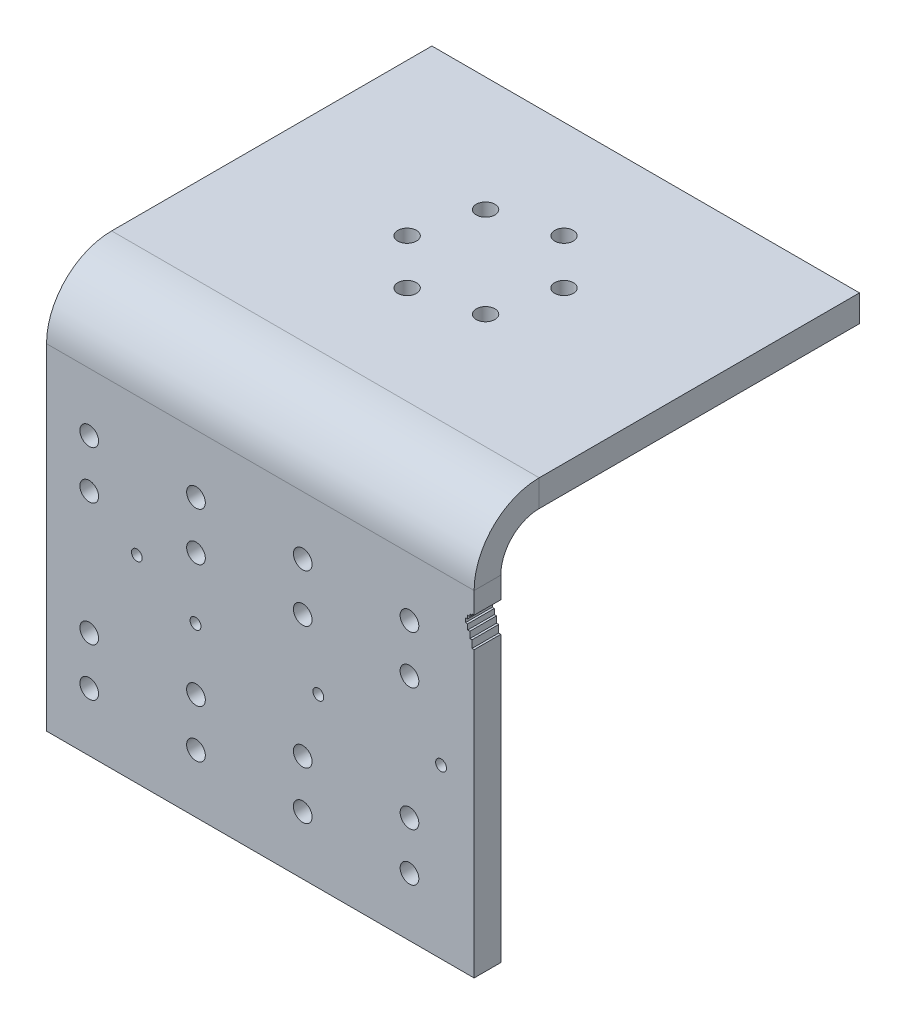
ISO-10303-21;
HEADER;
FILE_DESCRIPTION(('STEP AP214'),'2;1');
FILE_NAME('part.step','',(''),(''),'','','');
FILE_SCHEMA(('AUTOMOTIVE_DESIGN { 1 0 10303 214 1 1 1 1 }'));
ENDSEC;
DATA;
#1=APPLICATION_CONTEXT('core data for automotive mechanical design processes');
#2=APPLICATION_PROTOCOL_DEFINITION('international standard','automotive_design',2000,#1);
#3=PRODUCT_CONTEXT('',#1,'mechanical');
#4=PRODUCT('Part','Part','',(#3));
#5=PRODUCT_RELATED_PRODUCT_CATEGORY('part','',(#4));
#6=PRODUCT_DEFINITION_FORMATION('','',#4);
#7=PRODUCT_DEFINITION_CONTEXT('part definition',#1,'design');
#8=PRODUCT_DEFINITION('design','',#6,#7);
#9=PRODUCT_DEFINITION_SHAPE('','',#8);
#10=(LENGTH_UNIT() NAMED_UNIT(*) SI_UNIT(.MILLI.,.METRE.));
#11=(NAMED_UNIT(*) PLANE_ANGLE_UNIT() SI_UNIT($,.RADIAN.));
#12=(NAMED_UNIT(*) SI_UNIT($,.STERADIAN.) SOLID_ANGLE_UNIT());
#13=UNCERTAINTY_MEASURE_WITH_UNIT(LENGTH_MEASURE(1.E-05),#10,'distance_accuracy_value','');
#14=(GEOMETRIC_REPRESENTATION_CONTEXT(3) GLOBAL_UNCERTAINTY_ASSIGNED_CONTEXT((#13)) GLOBAL_UNIT_ASSIGNED_CONTEXT((#10,
#11,#12)) REPRESENTATION_CONTEXT('',''));
#15=CARTESIAN_POINT('',(0.,0.,0.));
#16=DIRECTION('',(0.,0.,1.));
#17=DIRECTION('',(1.,0.,0.));
#18=AXIS2_PLACEMENT_3D('',#15,#16,#17);
#19=CARTESIAN_POINT('',(0.,6.10184869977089E-13,211.));
#20=DIRECTION('',(0.,0.,-1.));
#21=DIRECTION('',(0.,1.,0.));
#22=AXIS2_PLACEMENT_3D('',#19,#20,#21);
#23=PLANE('',#22);
#24=CARTESIAN_POINT('',(54.3179214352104,-218.165,211.));
#25=DIRECTION('',(0.,0.,1.));
#26=DIRECTION('',(1.,0.,0.));
#27=AXIS2_PLACEMENT_3D('',#24,#25,#26);
#28=CIRCLE('',#27,5.09999999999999);
#29=CARTESIAN_POINT('',(59.4179214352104,-218.165,211.));
#30=VERTEX_POINT('',#29);
#31=EDGE_CURVE('E245',#30,#30,#28,.T.);
#32=ORIENTED_EDGE('',*,*,#31,.F.);
#33=EDGE_LOOP('',(#32));
#34=FACE_BOUND('',#33,.T.);
#35=CARTESIAN_POINT('',(169.31792143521,-218.165,211.));
#36=DIRECTION('',(0.,0.,1.));
#37=DIRECTION('',(1.,0.,0.));
#38=AXIS2_PLACEMENT_3D('',#35,#36,#37);
#39=CIRCLE('',#38,5.09999999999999);
#40=CARTESIAN_POINT('',(174.41792143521,-218.165,211.));
#41=VERTEX_POINT('',#40);
#42=EDGE_CURVE('E241',#41,#41,#39,.T.);
#43=ORIENTED_EDGE('',*,*,#42,.F.);
#44=EDGE_LOOP('',(#43));
#45=FACE_BOUND('',#44,.T.);
#46=CARTESIAN_POINT('',(-160.275,-115.665,211.));
#47=DIRECTION('',(0.,0.,1.));
#48=DIRECTION('',(1.,0.,0.));
#49=AXIS2_PLACEMENT_3D('',#46,#47,#48);
#50=CIRCLE('',#49,8.74999999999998);
#51=CARTESIAN_POINT('',(-151.525,-115.665,211.));
#52=VERTEX_POINT('',#51);
#53=EDGE_CURVE('E236',#52,#52,#50,.T.);
#54=ORIENTED_EDGE('',*,*,#53,.F.);
#55=EDGE_LOOP('',(#54));
#56=FACE_BOUND('',#55,.T.);
#57=CARTESIAN_POINT('',(-160.275,-160.665,211.));
#58=DIRECTION('',(0.,0.,1.));
#59=DIRECTION('',(1.,0.,0.));
#60=AXIS2_PLACEMENT_3D('',#57,#58,#59);
#61=CIRCLE('',#60,8.74999999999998);
#62=CARTESIAN_POINT('',(-151.525,-160.665,211.));
#63=VERTEX_POINT('',#62);
#64=EDGE_CURVE('E231',#63,#63,#61,.T.);
#65=ORIENTED_EDGE('',*,*,#64,.F.);
#66=EDGE_LOOP('',(#65));
#67=FACE_BOUND('',#66,.T.);
#68=CARTESIAN_POINT('',(-60.275,-115.665,211.));
#69=DIRECTION('',(0.,0.,1.));
#70=DIRECTION('',(1.,0.,0.));
#71=AXIS2_PLACEMENT_3D('',#68,#69,#70);
#72=CIRCLE('',#71,8.74999999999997);
#73=CARTESIAN_POINT('',(-51.525,-115.665,211.));
#74=VERTEX_POINT('',#73);
#75=EDGE_CURVE('E226',#74,#74,#72,.T.);
#76=ORIENTED_EDGE('',*,*,#75,.F.);
#77=EDGE_LOOP('',(#76));
#78=FACE_BOUND('',#77,.T.);
#79=CARTESIAN_POINT('',(-60.275,-160.665,211.));
#80=DIRECTION('',(0.,0.,1.));
#81=DIRECTION('',(1.,0.,0.));
#82=AXIS2_PLACEMENT_3D('',#79,#80,#81);
#83=CIRCLE('',#82,8.74999999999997);
#84=CARTESIAN_POINT('',(-51.525,-160.665,211.));
#85=VERTEX_POINT('',#84);
#86=EDGE_CURVE('E225',#85,#85,#83,.T.);
#87=ORIENTED_EDGE('',*,*,#86,.F.);
#88=EDGE_LOOP('',(#87));
#89=FACE_BOUND('',#88,.T.);
#90=CARTESIAN_POINT('',(39.725,-115.665,211.));
#91=DIRECTION('',(0.,0.,1.));
#92=DIRECTION('',(1.,0.,0.));
#93=AXIS2_PLACEMENT_3D('',#90,#91,#92);
#94=CIRCLE('',#93,8.74999999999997);
#95=CARTESIAN_POINT('',(48.475,-115.665,211.));
#96=VERTEX_POINT('',#95);
#97=EDGE_CURVE('E507',#96,#96,#94,.T.);
#98=ORIENTED_EDGE('',*,*,#97,.F.);
#99=EDGE_LOOP('',(#98));
#100=FACE_BOUND('',#99,.T.);
#101=CARTESIAN_POINT('',(39.725,-160.665,211.));
#102=DIRECTION('',(0.,0.,1.));
#103=DIRECTION('',(1.,0.,0.));
#104=AXIS2_PLACEMENT_3D('',#101,#102,#103);
#105=CIRCLE('',#104,8.74999999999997);
#106=CARTESIAN_POINT('',(48.475,-160.665,211.));
#107=VERTEX_POINT('',#106);
#108=EDGE_CURVE('E220',#107,#107,#105,.T.);
#109=ORIENTED_EDGE('',*,*,#108,.F.);
#110=EDGE_LOOP('',(#109));
#111=FACE_BOUND('',#110,.T.);
#112=CARTESIAN_POINT('',(139.725,-115.665,211.));
#113=DIRECTION('',(0.,0.,1.));
#114=DIRECTION('',(1.,0.,0.));
#115=AXIS2_PLACEMENT_3D('',#112,#113,#114);
#116=CIRCLE('',#115,8.74999999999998);
#117=CARTESIAN_POINT('',(148.475,-115.665,211.));
#118=VERTEX_POINT('',#117);
#119=EDGE_CURVE('E215',#118,#118,#116,.T.);
#120=ORIENTED_EDGE('',*,*,#119,.F.);
#121=EDGE_LOOP('',(#120));
#122=FACE_BOUND('',#121,.T.);
#123=CARTESIAN_POINT('',(139.725,-160.665,211.));
#124=DIRECTION('',(0.,0.,1.));
#125=DIRECTION('',(1.,0.,0.));
#126=AXIS2_PLACEMENT_3D('',#123,#124,#125);
#127=CIRCLE('',#126,8.74999999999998);
#128=CARTESIAN_POINT('',(148.475,-160.665,211.));
#129=VERTEX_POINT('',#128);
#130=EDGE_CURVE('E214',#129,#129,#127,.T.);
#131=ORIENTED_EDGE('',*,*,#130,.F.);
#132=EDGE_LOOP('',(#131));
#133=FACE_BOUND('',#132,.T.);
#134=CARTESIAN_POINT('',(-160.275,-275.665,211.));
#135=DIRECTION('',(0.,0.,1.));
#136=DIRECTION('',(1.,0.,0.));
#137=AXIS2_PLACEMENT_3D('',#134,#135,#136);
#138=CIRCLE('',#137,8.74999999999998);
#139=CARTESIAN_POINT('',(-151.525,-275.665,211.));
#140=VERTEX_POINT('',#139);
#141=EDGE_CURVE('E528',#140,#140,#138,.T.);
#142=ORIENTED_EDGE('',*,*,#141,.F.);
#143=EDGE_LOOP('',(#142));
#144=FACE_BOUND('',#143,.T.);
#145=CARTESIAN_POINT('',(-160.275,-320.665,211.));
#146=DIRECTION('',(0.,0.,1.));
#147=DIRECTION('',(1.,0.,0.));
#148=AXIS2_PLACEMENT_3D('',#145,#146,#147);
#149=CIRCLE('',#148,8.74999999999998);
#150=CARTESIAN_POINT('',(-151.525,-320.665,211.));
#151=VERTEX_POINT('',#150);
#152=EDGE_CURVE('E209',#151,#151,#149,.T.);
#153=ORIENTED_EDGE('',*,*,#152,.F.);
#154=EDGE_LOOP('',(#153));
#155=FACE_BOUND('',#154,.T.);
#156=CARTESIAN_POINT('',(-60.2749999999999,-275.665,211.));
#157=DIRECTION('',(0.,0.,1.));
#158=DIRECTION('',(1.,0.,0.));
#159=AXIS2_PLACEMENT_3D('',#156,#157,#158);
#160=CIRCLE('',#159,8.74999999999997);
#161=CARTESIAN_POINT('',(-51.5249999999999,-275.665,211.));
#162=VERTEX_POINT('',#161);
#163=EDGE_CURVE('E204',#162,#162,#160,.T.);
#164=ORIENTED_EDGE('',*,*,#163,.F.);
#165=EDGE_LOOP('',(#164));
#166=FACE_BOUND('',#165,.T.);
#167=CARTESIAN_POINT('',(-60.2749999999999,-320.665,211.));
#168=DIRECTION('',(0.,0.,1.));
#169=DIRECTION('',(1.,0.,0.));
#170=AXIS2_PLACEMENT_3D('',#167,#168,#169);
#171=CIRCLE('',#170,8.74999999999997);
#172=CARTESIAN_POINT('',(-51.5249999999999,-320.665,211.));
#173=VERTEX_POINT('',#172);
#174=EDGE_CURVE('E199',#173,#173,#171,.T.);
#175=ORIENTED_EDGE('',*,*,#174,.F.);
#176=EDGE_LOOP('',(#175));
#177=FACE_BOUND('',#176,.T.);
#178=CARTESIAN_POINT('',(39.7250000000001,-275.665,211.));
#179=DIRECTION('',(0.,0.,1.));
#180=DIRECTION('',(1.,0.,0.));
#181=AXIS2_PLACEMENT_3D('',#178,#179,#180);
#182=CIRCLE('',#181,8.74999999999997);
#183=CARTESIAN_POINT('',(48.4750000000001,-275.665,211.));
#184=VERTEX_POINT('',#183);
#185=EDGE_CURVE('E194',#184,#184,#182,.T.);
#186=ORIENTED_EDGE('',*,*,#185,.F.);
#187=EDGE_LOOP('',(#186));
#188=FACE_BOUND('',#187,.T.);
#189=CARTESIAN_POINT('',(39.7250000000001,-320.665,211.));
#190=DIRECTION('',(0.,0.,1.));
#191=DIRECTION('',(1.,0.,0.));
#192=AXIS2_PLACEMENT_3D('',#189,#190,#191);
#193=CIRCLE('',#192,8.74999999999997);
#194=CARTESIAN_POINT('',(48.4750000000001,-320.665,211.));
#195=VERTEX_POINT('',#194);
#196=EDGE_CURVE('E189',#195,#195,#193,.T.);
#197=ORIENTED_EDGE('',*,*,#196,.F.);
#198=EDGE_LOOP('',(#197));
#199=FACE_BOUND('',#198,.T.);
#200=CARTESIAN_POINT('',(139.725,-275.665,211.));
#201=DIRECTION('',(0.,0.,1.));
#202=DIRECTION('',(1.,0.,0.));
#203=AXIS2_PLACEMENT_3D('',#200,#201,#202);
#204=CIRCLE('',#203,8.74999999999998);
#205=CARTESIAN_POINT('',(148.475,-275.665,211.));
#206=VERTEX_POINT('',#205);
#207=EDGE_CURVE('E184',#206,#206,#204,.T.);
#208=ORIENTED_EDGE('',*,*,#207,.F.);
#209=EDGE_LOOP('',(#208));
#210=FACE_BOUND('',#209,.T.);
#211=CARTESIAN_POINT('',(139.725,-320.665,211.));
#212=DIRECTION('',(0.,0.,1.));
#213=DIRECTION('',(1.,0.,0.));
#214=AXIS2_PLACEMENT_3D('',#211,#212,#213);
#215=CIRCLE('',#214,8.74999999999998);
#216=CARTESIAN_POINT('',(148.475,-320.665,211.));
#217=VERTEX_POINT('',#216);
#218=EDGE_CURVE('E179',#217,#217,#215,.T.);
#219=ORIENTED_EDGE('',*,*,#218,.F.);
#220=EDGE_LOOP('',(#219));
#221=FACE_BOUND('',#220,.T.);
#222=DIRECTION('',(0.,1.,0.));
#223=VECTOR('',#222,1.);
#224=CARTESIAN_POINT('',(200.275,6.10184869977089E-13,211.));
#225=LINE('',#224,#223);
#226=CARTESIAN_POINT('',(200.275,-375.33,211.000000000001));
#227=VERTEX_POINT('',#226);
#228=CARTESIAN_POINT('',(200.275,-109.,211.));
#229=VERTEX_POINT('',#228);
#230=EDGE_CURVE('E566',#227,#229,#225,.T.);
#231=ORIENTED_EDGE('',*,*,#230,.T.);
#232=DIRECTION('',(1.,0.,0.));
#233=VECTOR('',#232,1.);
#234=CARTESIAN_POINT('',(198.275,-109.,211.));
#235=LINE('',#234,#233);
#236=CARTESIAN_POINT('',(198.275,-109.,211.));
#237=VERTEX_POINT('',#236);
#238=EDGE_CURVE('E378',#237,#229,#235,.T.);
#239=ORIENTED_EDGE('',*,*,#238,.F.);
#240=DIRECTION('',(0.,-1.,0.));
#241=VECTOR('',#240,1.);
#242=CARTESIAN_POINT('',(198.275,-102.,211.));
#243=LINE('',#242,#241);
#244=CARTESIAN_POINT('',(198.275,-102.,211.));
#245=VERTEX_POINT('',#244);
#246=EDGE_CURVE('E374',#245,#237,#243,.T.);
#247=ORIENTED_EDGE('',*,*,#246,.F.);
#248=DIRECTION('',(1.,0.,0.));
#249=VECTOR('',#248,1.);
#250=CARTESIAN_POINT('',(196.275,-102.,211.));
#251=LINE('',#250,#249);
#252=CARTESIAN_POINT('',(196.275,-102.,211.));
#253=VERTEX_POINT('',#252);
#254=EDGE_CURVE('E370',#253,#245,#251,.T.);
#255=ORIENTED_EDGE('',*,*,#254,.F.);
#256=DIRECTION('',(0.,-1.,0.));
#257=VECTOR('',#256,1.);
#258=CARTESIAN_POINT('',(196.275,-95.9999999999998,211.));
#259=LINE('',#258,#257);
#260=CARTESIAN_POINT('',(196.275,-95.9999999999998,211.));
#261=VERTEX_POINT('',#260);
#262=EDGE_CURVE('E366',#261,#253,#259,.T.);
#263=ORIENTED_EDGE('',*,*,#262,.F.);
#264=DIRECTION('',(1.,0.,0.));
#265=VECTOR('',#264,1.);
#266=CARTESIAN_POINT('',(194.275,-95.9999999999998,211.));
#267=LINE('',#266,#265);
#268=CARTESIAN_POINT('',(194.275,-95.9999999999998,211.));
#269=VERTEX_POINT('',#268);
#270=EDGE_CURVE('E362',#269,#261,#267,.T.);
#271=ORIENTED_EDGE('',*,*,#270,.F.);
#272=DIRECTION('',(0.,-1.,0.));
#273=VECTOR('',#272,1.);
#274=CARTESIAN_POINT('',(194.275,-90.9999999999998,211.));
#275=LINE('',#274,#273);
#276=CARTESIAN_POINT('',(194.275,-90.9999999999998,211.));
#277=VERTEX_POINT('',#276);
#278=EDGE_CURVE('E358',#277,#269,#275,.T.);
#279=ORIENTED_EDGE('',*,*,#278,.F.);
#280=DIRECTION('',(1.,0.,0.));
#281=VECTOR('',#280,1.);
#282=CARTESIAN_POINT('',(192.275,-90.9999999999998,211.));
#283=LINE('',#282,#281);
#284=CARTESIAN_POINT('',(192.275,-90.9999999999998,211.));
#285=VERTEX_POINT('',#284);
#286=EDGE_CURVE('E354',#285,#277,#283,.T.);
#287=ORIENTED_EDGE('',*,*,#286,.F.);
#288=DIRECTION('',(0.,-1.,0.));
#289=VECTOR('',#288,1.);
#290=CARTESIAN_POINT('',(192.275,-86.9999999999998,211.));
#291=LINE('',#290,#289);
#292=CARTESIAN_POINT('',(192.275,-86.9999999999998,211.));
#293=VERTEX_POINT('',#292);
#294=EDGE_CURVE('E350',#293,#285,#291,.T.);
#295=ORIENTED_EDGE('',*,*,#294,.F.);
#296=DIRECTION('',(-1.,0.,0.));
#297=VECTOR('',#296,1.);
#298=CARTESIAN_POINT('',(194.275,-86.9999999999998,211.));
#299=LINE('',#298,#297);
#300=CARTESIAN_POINT('',(194.275,-86.9999999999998,211.));
#301=VERTEX_POINT('',#300);
#302=EDGE_CURVE('E346',#301,#293,#299,.T.);
#303=ORIENTED_EDGE('',*,*,#302,.F.);
#304=DIRECTION('',(0.,-1.,0.));
#305=VECTOR('',#304,1.);
#306=CARTESIAN_POINT('',(194.275,-83.9999999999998,211.));
#307=LINE('',#306,#305);
#308=CARTESIAN_POINT('',(194.275,-83.9999999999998,211.));
#309=VERTEX_POINT('',#308);
#310=EDGE_CURVE('E342',#309,#301,#307,.T.);
#311=ORIENTED_EDGE('',*,*,#310,.F.);
#312=DIRECTION('',(-1.,0.,0.));
#313=VECTOR('',#312,1.);
#314=CARTESIAN_POINT('',(196.275,-83.9999999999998,211.));
#315=LINE('',#314,#313);
#316=CARTESIAN_POINT('',(196.275,-83.9999999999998,211.));
#317=VERTEX_POINT('',#316);
#318=EDGE_CURVE('E338',#317,#309,#315,.T.);
#319=ORIENTED_EDGE('',*,*,#318,.F.);
#320=DIRECTION('',(0.,-1.,0.));
#321=VECTOR('',#320,1.);
#322=CARTESIAN_POINT('',(196.275,-81.9999999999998,211.));
#323=LINE('',#322,#321);
#324=CARTESIAN_POINT('',(196.275,-81.9999999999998,211.));
#325=VERTEX_POINT('',#324);
#326=EDGE_CURVE('E334',#325,#317,#323,.T.);
#327=ORIENTED_EDGE('',*,*,#326,.F.);
#328=DIRECTION('',(-1.,0.,0.));
#329=VECTOR('',#328,1.);
#330=CARTESIAN_POINT('',(198.275,-81.9999999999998,211.));
#331=LINE('',#330,#329);
#332=CARTESIAN_POINT('',(198.275,-81.9999999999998,211.));
#333=VERTEX_POINT('',#332);
#334=EDGE_CURVE('E330',#333,#325,#331,.T.);
#335=ORIENTED_EDGE('',*,*,#334,.F.);
#336=DIRECTION('',(0.,-1.,0.));
#337=VECTOR('',#336,1.);
#338=CARTESIAN_POINT('',(198.275,-80.9999999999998,211.));
#339=LINE('',#338,#337);
#340=CARTESIAN_POINT('',(198.275,-80.9999999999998,211.));
#341=VERTEX_POINT('',#340);
#342=EDGE_CURVE('E326',#341,#333,#339,.T.);
#343=ORIENTED_EDGE('',*,*,#342,.F.);
#344=DIRECTION('',(-1.,0.,0.));
#345=VECTOR('',#344,1.);
#346=CARTESIAN_POINT('',(200.275,-80.9999999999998,211.));
#347=LINE('',#346,#345);
#348=CARTESIAN_POINT('',(200.275,-80.9999999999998,211.));
#349=VERTEX_POINT('',#348);
#350=EDGE_CURVE('E323',#349,#341,#347,.T.);
#351=ORIENTED_EDGE('',*,*,#350,.F.);
#352=CARTESIAN_POINT('',(200.275,-60.9999999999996,211.));
#353=VERTEX_POINT('',#352);
#354=EDGE_CURVE('E570',#349,#353,#225,.T.);
#355=ORIENTED_EDGE('',*,*,#354,.T.);
#356=DIRECTION('',(-1.,0.,0.));
#357=VECTOR('',#356,1.);
#358=CARTESIAN_POINT('',(200.275,-60.9999999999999,211.));
#359=LINE('',#358,#357);
#360=CARTESIAN_POINT('',(-200.275,-60.9999999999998,211.));
#361=VERTEX_POINT('',#360);
#362=EDGE_CURVE('E125',#361,#353,#359,.F.);
#363=ORIENTED_EDGE('',*,*,#362,.F.);
#364=DIRECTION('',(0.,-1.,0.));
#365=VECTOR('',#364,1.);
#366=CARTESIAN_POINT('',(-200.275,5.78450517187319E-13,211.));
#367=LINE('',#366,#365);
#368=CARTESIAN_POINT('',(-200.275,-375.33,211.000000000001));
#369=VERTEX_POINT('',#368);
#370=EDGE_CURVE('E575',#361,#369,#367,.T.);
#371=ORIENTED_EDGE('',*,*,#370,.T.);
#372=DIRECTION('',(1.,0.,0.));
#373=VECTOR('',#372,1.);
#374=CARTESIAN_POINT('',(0.,-375.33,211.000000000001));
#375=LINE('',#374,#373);
#376=EDGE_CURVE('E571',#369,#227,#375,.T.);
#377=ORIENTED_EDGE('',*,*,#376,.T.);
#378=EDGE_LOOP('',(#231,#239,#247,#255,#263,#271,#279,#287,#295,#303,#311,#319,#327,#335,#343,
#351,#355,#363,#371,#377));
#379=FACE_BOUND('',#378,.T.);
#380=CARTESIAN_POINT('',(-60.6820785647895,-218.165,211.));
#381=DIRECTION('',(0.,0.,1.));
#382=DIRECTION('',(1.,0.,0.));
#383=AXIS2_PLACEMENT_3D('',#380,#381,#382);
#384=CIRCLE('',#383,5.09999999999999);
#385=CARTESIAN_POINT('',(-55.5820785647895,-218.165,211.));
#386=VERTEX_POINT('',#385);
#387=EDGE_CURVE('E261',#386,#386,#384,.T.);
#388=ORIENTED_EDGE('',*,*,#387,.F.);
#389=EDGE_LOOP('',(#388));
#390=FACE_BOUND('',#389,.T.);
#391=CARTESIAN_POINT('',(-115.702681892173,-190.231868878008,211.));
#392=DIRECTION('',(0.,0.,1.));
#393=DIRECTION('',(1.,0.,0.));
#394=AXIS2_PLACEMENT_3D('',#391,#392,#393);
#395=CIRCLE('',#394,4.99999999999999);
#396=CARTESIAN_POINT('',(-110.702681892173,-190.231868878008,211.));
#397=VERTEX_POINT('',#396);
#398=EDGE_CURVE('E764',#397,#397,#395,.T.);
#399=ORIENTED_EDGE('',*,*,#398,.F.);
#400=EDGE_LOOP('',(#399));
#401=FACE_BOUND('',#400,.T.);
#402=ADVANCED_FACE('F73',(#34,#45,#56,#67,#78,#89,#100,#111,#122,#133,#144,#155,#166,#177,#188,
#199,#210,#221,#379,#390,#401),#23,.F.);
#403=CARTESIAN_POINT('',(200.275,-24.9999999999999,211.));
#404=DIRECTION('',(-1.,0.,0.));
#405=DIRECTION('',(0.,0.,1.));
#406=AXIS2_PLACEMENT_3D('',#403,#404,#405);
#407=PLANE('',#406);
#408=DIRECTION('',(0.,-1.,0.));
#409=VECTOR('',#408,1.);
#410=CARTESIAN_POINT('',(200.275,-25.,186.));
#411=LINE('',#410,#409);
#412=CARTESIAN_POINT('',(200.275,-375.33,186.000000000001));
#413=VERTEX_POINT('',#412);
#414=CARTESIAN_POINT('',(200.275,-109.,186.));
#415=VERTEX_POINT('',#414);
#416=EDGE_CURVE('E579',#413,#415,#411,.F.);
#417=ORIENTED_EDGE('',*,*,#416,.T.);
#418=DIRECTION('',(0.,0.,1.));
#419=VECTOR('',#418,1.);
#420=CARTESIAN_POINT('',(200.275,-109.,-150.001));
#421=LINE('',#420,#419);
#422=EDGE_CURVE('E382',#415,#229,#421,.T.);
#423=ORIENTED_EDGE('',*,*,#422,.T.);
#424=ORIENTED_EDGE('',*,*,#230,.F.);
#425=DIRECTION('',(0.,0.,-1.));
#426=VECTOR('',#425,1.);
#427=CARTESIAN_POINT('',(200.275,-375.33,211.000000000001));
#428=LINE('',#427,#426);
#429=EDGE_CURVE('E562',#227,#413,#428,.T.);
#430=ORIENTED_EDGE('',*,*,#429,.T.);
#431=EDGE_LOOP('',(#417,#423,#424,#430));
#432=FACE_BOUND('',#431,.T.);
#433=ADVANCED_FACE('F741',(#432),#407,.F.);
#434=CARTESIAN_POINT('',(200.275,-25.,150.));
#435=DIRECTION('',(1.,0.,0.));
#436=DIRECTION('',(0.,0.,-1.));
#437=AXIS2_PLACEMENT_3D('',#434,#435,#436);
#438=PLANE('',#437);
#439=DIRECTION('',(0.,0.,-1.));
#440=VECTOR('',#439,1.);
#441=CARTESIAN_POINT('',(200.275,0.,150.));
#442=LINE('',#441,#440);
#443=CARTESIAN_POINT('',(200.275,0.,150.));
#444=VERTEX_POINT('',#443);
#445=CARTESIAN_POINT('',(200.275,0.,-150.));
#446=VERTEX_POINT('',#445);
#447=EDGE_CURVE('E130',#444,#446,#442,.T.);
#448=ORIENTED_EDGE('',*,*,#447,.F.);
#449=DIRECTION('',(0.,1.,0.));
#450=VECTOR('',#449,1.);
#451=CARTESIAN_POINT('',(200.275,-25.,150.));
#452=LINE('',#451,#450);
#453=CARTESIAN_POINT('',(200.275,-24.9999999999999,150.));
#454=VERTEX_POINT('',#453);
#455=EDGE_CURVE('E13',#454,#444,#452,.T.);
#456=ORIENTED_EDGE('',*,*,#455,.F.);
#457=DIRECTION('',(0.,0.,-1.));
#458=VECTOR('',#457,1.);
#459=CARTESIAN_POINT('',(200.275,-25.,150.));
#460=LINE('',#459,#458);
#461=CARTESIAN_POINT('',(200.275,-25.,-150.));
#462=VERTEX_POINT('',#461);
#463=EDGE_CURVE('E155',#454,#462,#460,.T.);
#464=ORIENTED_EDGE('',*,*,#463,.T.);
#465=DIRECTION('',(0.,1.,0.));
#466=VECTOR('',#465,1.);
#467=CARTESIAN_POINT('',(200.275,-25.,-150.));
#468=LINE('',#467,#466);
#469=EDGE_CURVE('E144',#462,#446,#468,.T.);
#470=ORIENTED_EDGE('',*,*,#469,.T.);
#471=EDGE_LOOP('',(#448,#456,#464,#470));
#472=FACE_BOUND('',#471,.T.);
#473=ADVANCED_FACE('F75',(#472),#438,.T.);
#474=CARTESIAN_POINT('',(-200.275,-25.,150.));
#475=DIRECTION('',(-1.,0.,0.));
#476=DIRECTION('',(0.,0.,1.));
#477=AXIS2_PLACEMENT_3D('',#474,#475,#476);
#478=PLANE('',#477);
#479=DIRECTION('',(0.,0.,1.));
#480=VECTOR('',#479,1.);
#481=CARTESIAN_POINT('',(-200.275,0.,150.));
#482=LINE('',#481,#480);
#483=CARTESIAN_POINT('',(-200.275,0.,-150.));
#484=VERTEX_POINT('',#483);
#485=CARTESIAN_POINT('',(-200.275,1.31838984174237E-13,150.));
#486=VERTEX_POINT('',#485);
#487=EDGE_CURVE('E153',#484,#486,#482,.T.);
#488=ORIENTED_EDGE('',*,*,#487,.F.);
#489=DIRECTION('',(0.,1.,0.));
#490=VECTOR('',#489,1.);
#491=CARTESIAN_POINT('',(-200.275,-25.,-150.));
#492=LINE('',#491,#490);
#493=CARTESIAN_POINT('',(-200.275,-25.,-150.));
#494=VERTEX_POINT('',#493);
#495=EDGE_CURVE('E100',#494,#484,#492,.T.);
#496=ORIENTED_EDGE('',*,*,#495,.F.);
#497=DIRECTION('',(0.,0.,1.));
#498=VECTOR('',#497,1.);
#499=CARTESIAN_POINT('',(-200.275,-25.,150.));
#500=LINE('',#499,#498);
#501=CARTESIAN_POINT('',(-200.275,-24.9999999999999,150.));
#502=VERTEX_POINT('',#501);
#503=EDGE_CURVE('E612',#494,#502,#500,.T.);
#504=ORIENTED_EDGE('',*,*,#503,.T.);
#505=DIRECTION('',(0.,1.,0.));
#506=VECTOR('',#505,1.);
#507=CARTESIAN_POINT('',(-200.275,-25.,150.));
#508=LINE('',#507,#506);
#509=EDGE_CURVE('E83',#502,#486,#508,.T.);
#510=ORIENTED_EDGE('',*,*,#509,.T.);
#511=EDGE_LOOP('',(#488,#496,#504,#510));
#512=FACE_BOUND('',#511,.T.);
#513=ADVANCED_FACE('F620',(#512),#478,.T.);
#514=CARTESIAN_POINT('',(-200.275,-25.,-150.));
#515=DIRECTION('',(0.,0.,-1.));
#516=DIRECTION('',(-1.,0.,0.));
#517=AXIS2_PLACEMENT_3D('',#514,#515,#516);
#518=PLANE('',#517);
#519=DIRECTION('',(-1.,0.,0.));
#520=VECTOR('',#519,1.);
#521=CARTESIAN_POINT('',(-200.275,0.,-150.));
#522=LINE('',#521,#520);
#523=EDGE_CURVE('E149',#446,#484,#522,.T.);
#524=ORIENTED_EDGE('',*,*,#523,.F.);
#525=ORIENTED_EDGE('',*,*,#469,.F.);
#526=DIRECTION('',(-1.,0.,0.));
#527=VECTOR('',#526,1.);
#528=CARTESIAN_POINT('',(-200.275,-25.,-150.));
#529=LINE('',#528,#527);
#530=EDGE_CURVE('E160',#462,#494,#529,.T.);
#531=ORIENTED_EDGE('',*,*,#530,.T.);
#532=ORIENTED_EDGE('',*,*,#495,.T.);
#533=EDGE_LOOP('',(#524,#525,#531,#532));
#534=FACE_BOUND('',#533,.T.);
#535=ADVANCED_FACE('F618',(#534),#518,.T.);
#536=CARTESIAN_POINT('',(0.,-25.,0.));
#537=DIRECTION('',(0.,-1.,0.));
#538=DIRECTION('',(0.,0.,-1.));
#539=AXIS2_PLACEMENT_3D('',#536,#537,#538);
#540=PLANE('',#539);
#541=CARTESIAN_POINT('',(-57.9555495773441,-25.,15.5291427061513));
#542=DIRECTION('',(0.,-1.,0.));
#543=DIRECTION('',(0.,0.,-1.));
#544=AXIS2_PLACEMENT_3D('',#541,#542,#543);
#545=CIRCLE('',#544,8.74999999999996);
#546=CARTESIAN_POINT('',(-57.9555495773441,-25.,6.77914270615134));
#547=VERTEX_POINT('',#546);
#548=EDGE_CURVE('E447',#547,#547,#545,.T.);
#549=ORIENTED_EDGE('',*,*,#548,.F.);
#550=EDGE_LOOP('',(#549));
#551=FACE_BOUND('',#550,.T.);
#552=CARTESIAN_POINT('',(-42.4264068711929,-25.,-42.4264068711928));
#553=DIRECTION('',(0.,-1.,0.));
#554=DIRECTION('',(0.,0.,-1.));
#555=AXIS2_PLACEMENT_3D('',#552,#553,#554);
#556=CIRCLE('',#555,8.74999999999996);
#557=CARTESIAN_POINT('',(-42.4264068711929,-25.,-51.1764068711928));
#558=VERTEX_POINT('',#557);
#559=EDGE_CURVE('E455',#558,#558,#556,.T.);
#560=ORIENTED_EDGE('',*,*,#559,.F.);
#561=EDGE_LOOP('',(#560));
#562=FACE_BOUND('',#561,.T.);
#563=CARTESIAN_POINT('',(15.5291427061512,-25.,-57.9555495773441));
#564=DIRECTION('',(0.,-1.,0.));
#565=DIRECTION('',(0.,0.,-1.));
#566=AXIS2_PLACEMENT_3D('',#563,#564,#565);
#567=CIRCLE('',#566,8.74999999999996);
#568=CARTESIAN_POINT('',(15.5291427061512,-25.,-66.7055495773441));
#569=VERTEX_POINT('',#568);
#570=EDGE_CURVE('E463',#569,#569,#567,.T.);
#571=ORIENTED_EDGE('',*,*,#570,.F.);
#572=EDGE_LOOP('',(#571));
#573=FACE_BOUND('',#572,.T.);
#574=CARTESIAN_POINT('',(57.9555495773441,-25.,-15.5291427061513));
#575=DIRECTION('',(0.,-1.,0.));
#576=DIRECTION('',(0.,0.,-1.));
#577=AXIS2_PLACEMENT_3D('',#574,#575,#576);
#578=CIRCLE('',#577,8.74999999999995);
#579=CARTESIAN_POINT('',(57.9555495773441,-25.,-24.2791427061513));
#580=VERTEX_POINT('',#579);
#581=EDGE_CURVE('E471',#580,#580,#578,.T.);
#582=ORIENTED_EDGE('',*,*,#581,.F.);
#583=EDGE_LOOP('',(#582));
#584=FACE_BOUND('',#583,.T.);
#585=CARTESIAN_POINT('',(42.4264068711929,-25.,42.4264068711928));
#586=DIRECTION('',(0.,-1.,0.));
#587=DIRECTION('',(0.,0.,-1.));
#588=AXIS2_PLACEMENT_3D('',#585,#586,#587);
#589=CIRCLE('',#588,8.74999999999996);
#590=CARTESIAN_POINT('',(42.4264068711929,-25.,33.6764068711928));
#591=VERTEX_POINT('',#590);
#592=EDGE_CURVE('E479',#591,#591,#589,.T.);
#593=ORIENTED_EDGE('',*,*,#592,.F.);
#594=EDGE_LOOP('',(#593));
#595=FACE_BOUND('',#594,.T.);
#596=CARTESIAN_POINT('',(-15.5291427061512,-25.,57.9555495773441));
#597=DIRECTION('',(0.,-1.,0.));
#598=DIRECTION('',(0.,0.,-1.));
#599=AXIS2_PLACEMENT_3D('',#596,#597,#598);
#600=CIRCLE('',#599,8.74999999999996);
#601=CARTESIAN_POINT('',(-15.5291427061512,-25.,49.2055495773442));
#602=VERTEX_POINT('',#601);
#603=EDGE_CURVE('E487',#602,#602,#600,.T.);
#604=ORIENTED_EDGE('',*,*,#603,.F.);
#605=EDGE_LOOP('',(#604));
#606=FACE_BOUND('',#605,.T.);
#607=ORIENTED_EDGE('',*,*,#463,.F.);
#608=DIRECTION('',(1.,0.,0.));
#609=VECTOR('',#608,1.);
#610=CARTESIAN_POINT('',(-200.275,-25.,150.));
#611=LINE('',#610,#609);
#612=EDGE_CURVE('E173',#502,#454,#611,.T.);
#613=ORIENTED_EDGE('',*,*,#612,.F.);
#614=ORIENTED_EDGE('',*,*,#503,.F.);
#615=ORIENTED_EDGE('',*,*,#530,.F.);
#616=EDGE_LOOP('',(#607,#613,#614,#615));
#617=FACE_BOUND('',#616,.T.);
#618=ADVANCED_FACE('F802',(#551,#562,#573,#584,#595,#606,#617),#540,.T.);
#619=CARTESIAN_POINT('',(0.,0.,0.));
#620=DIRECTION('',(0.,-1.,0.));
#621=DIRECTION('',(0.,0.,-1.));
#622=AXIS2_PLACEMENT_3D('',#619,#620,#621);
#623=PLANE('',#622);
#624=CARTESIAN_POINT('',(-57.9555495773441,0.,15.5291427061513));
#625=DIRECTION('',(0.,1.,0.));
#626=DIRECTION('',(0.,0.,1.));
#627=AXIS2_PLACEMENT_3D('',#624,#625,#626);
#628=CIRCLE('',#627,8.75);
#629=CARTESIAN_POINT('',(-57.9555495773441,0.,24.2791427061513));
#630=VERTEX_POINT('',#629);
#631=EDGE_CURVE('E386',#630,#630,#628,.T.);
#632=ORIENTED_EDGE('',*,*,#631,.F.);
#633=EDGE_LOOP('',(#632));
#634=FACE_BOUND('',#633,.T.);
#635=CARTESIAN_POINT('',(-42.4264068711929,0.,-42.4264068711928));
#636=DIRECTION('',(0.,1.,0.));
#637=DIRECTION('',(0.,0.,1.));
#638=AXIS2_PLACEMENT_3D('',#635,#636,#637);
#639=CIRCLE('',#638,8.75);
#640=CARTESIAN_POINT('',(-42.4264068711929,0.,-33.6764068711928));
#641=VERTEX_POINT('',#640);
#642=EDGE_CURVE('E451',#641,#641,#639,.T.);
#643=ORIENTED_EDGE('',*,*,#642,.F.);
#644=EDGE_LOOP('',(#643));
#645=FACE_BOUND('',#644,.T.);
#646=CARTESIAN_POINT('',(15.5291427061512,0.,-57.9555495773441));
#647=DIRECTION('',(0.,1.,0.));
#648=DIRECTION('',(0.,0.,1.));
#649=AXIS2_PLACEMENT_3D('',#646,#647,#648);
#650=CIRCLE('',#649,8.75);
#651=CARTESIAN_POINT('',(15.5291427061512,0.,-49.2055495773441));
#652=VERTEX_POINT('',#651);
#653=EDGE_CURVE('E459',#652,#652,#650,.T.);
#654=ORIENTED_EDGE('',*,*,#653,.F.);
#655=EDGE_LOOP('',(#654));
#656=FACE_BOUND('',#655,.T.);
#657=CARTESIAN_POINT('',(57.9555495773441,0.,-15.5291427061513));
#658=DIRECTION('',(0.,1.,0.));
#659=DIRECTION('',(0.,0.,1.));
#660=AXIS2_PLACEMENT_3D('',#657,#658,#659);
#661=CIRCLE('',#660,8.75);
#662=CARTESIAN_POINT('',(57.9555495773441,0.,-6.77914270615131));
#663=VERTEX_POINT('',#662);
#664=EDGE_CURVE('E467',#663,#663,#661,.T.);
#665=ORIENTED_EDGE('',*,*,#664,.F.);
#666=EDGE_LOOP('',(#665));
#667=FACE_BOUND('',#666,.T.);
#668=CARTESIAN_POINT('',(42.4264068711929,0.,42.4264068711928));
#669=DIRECTION('',(0.,1.,0.));
#670=DIRECTION('',(0.,0.,1.));
#671=AXIS2_PLACEMENT_3D('',#668,#669,#670);
#672=CIRCLE('',#671,8.75);
#673=CARTESIAN_POINT('',(42.4264068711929,0.,51.1764068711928));
#674=VERTEX_POINT('',#673);
#675=EDGE_CURVE('E475',#674,#674,#672,.T.);
#676=ORIENTED_EDGE('',*,*,#675,.F.);
#677=EDGE_LOOP('',(#676));
#678=FACE_BOUND('',#677,.T.);
#679=CARTESIAN_POINT('',(-15.5291427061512,0.,57.9555495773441));
#680=DIRECTION('',(0.,1.,0.));
#681=DIRECTION('',(0.,0.,1.));
#682=AXIS2_PLACEMENT_3D('',#679,#680,#681);
#683=CIRCLE('',#682,8.75);
#684=CARTESIAN_POINT('',(-15.5291427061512,0.,66.7055495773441));
#685=VERTEX_POINT('',#684);
#686=EDGE_CURVE('E483',#685,#685,#683,.T.);
#687=ORIENTED_EDGE('',*,*,#686,.F.);
#688=EDGE_LOOP('',(#687));
#689=FACE_BOUND('',#688,.T.);
#690=ORIENTED_EDGE('',*,*,#447,.T.);
#691=ORIENTED_EDGE('',*,*,#523,.T.);
#692=ORIENTED_EDGE('',*,*,#487,.T.);
#693=DIRECTION('',(1.,0.,0.));
#694=VECTOR('',#693,1.);
#695=CARTESIAN_POINT('',(-200.275,0.,150.));
#696=LINE('',#695,#694);
#697=EDGE_CURVE('E121',#486,#444,#696,.T.);
#698=ORIENTED_EDGE('',*,*,#697,.T.);
#699=EDGE_LOOP('',(#690,#691,#692,#698));
#700=FACE_BOUND('',#699,.T.);
#701=ADVANCED_FACE('F152',(#634,#645,#656,#667,#678,#689,#700),#623,.F.);
#702=CARTESIAN_POINT('',(200.275,-60.9999999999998,150.));
#703=DIRECTION('',(1.,0.,0.));
#704=DIRECTION('',(0.,0.,-1.));
#705=AXIS2_PLACEMENT_3D('',#702,#703,#704);
#706=PLANE('',#705);
#707=DIRECTION('',(0.,0.,-1.));
#708=VECTOR('',#707,1.);
#709=CARTESIAN_POINT('',(200.275,-60.9999999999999,211.));
#710=LINE('',#709,#708);
#711=CARTESIAN_POINT('',(200.275,-60.9999999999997,186.));
#712=VERTEX_POINT('',#711);
#713=EDGE_CURVE('E178',#712,#353,#710,.F.);
#714=ORIENTED_EDGE('',*,*,#713,.F.);
#715=CARTESIAN_POINT('',(200.275,-60.9999999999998,150.));
#716=DIRECTION('',(-1.,0.,0.));
#717=DIRECTION('',(0.,0.,1.));
#718=AXIS2_PLACEMENT_3D('',#715,#716,#717);
#719=CIRCLE('',#718,36.);
#720=EDGE_CURVE('E139',#454,#712,#719,.F.);
#721=ORIENTED_EDGE('',*,*,#720,.F.);
#722=ORIENTED_EDGE('',*,*,#455,.T.);
#723=CARTESIAN_POINT('',(200.275,-60.9999999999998,150.));
#724=DIRECTION('',(-1.,0.,0.));
#725=DIRECTION('',(0.,0.,1.));
#726=AXIS2_PLACEMENT_3D('',#723,#724,#725);
#727=CIRCLE('',#726,61.);
#728=EDGE_CURVE('E117',#444,#353,#727,.F.);
#729=ORIENTED_EDGE('',*,*,#728,.T.);
#730=EDGE_LOOP('',(#714,#721,#722,#729));
#731=FACE_BOUND('',#730,.T.);
#732=ADVANCED_FACE('F136',(#731),#706,.T.);
#733=CARTESIAN_POINT('',(-200.275,-60.9999999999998,150.));
#734=DIRECTION('',(1.,0.,0.));
#735=DIRECTION('',(0.,0.,-1.));
#736=AXIS2_PLACEMENT_3D('',#733,#734,#735);
#737=PLANE('',#736);
#738=CARTESIAN_POINT('',(-200.275,-60.9999999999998,150.));
#739=DIRECTION('',(-1.,0.,0.));
#740=DIRECTION('',(0.,0.,1.));
#741=AXIS2_PLACEMENT_3D('',#738,#739,#740);
#742=CIRCLE('',#741,36.);
#743=CARTESIAN_POINT('',(-200.275,-60.9999999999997,186.));
#744=VERTEX_POINT('',#743);
#745=EDGE_CURVE('E561',#744,#502,#742,.T.);
#746=ORIENTED_EDGE('',*,*,#745,.F.);
#747=DIRECTION('',(0.,0.,-1.));
#748=VECTOR('',#747,1.);
#749=CARTESIAN_POINT('',(-200.275,-60.9999999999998,186.));
#750=LINE('',#749,#748);
#751=EDGE_CURVE('E594',#744,#361,#750,.F.);
#752=ORIENTED_EDGE('',*,*,#751,.T.);
#753=CARTESIAN_POINT('',(-200.275,-60.9999999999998,150.));
#754=DIRECTION('',(-1.,0.,0.));
#755=DIRECTION('',(0.,0.,1.));
#756=AXIS2_PLACEMENT_3D('',#753,#754,#755);
#757=CIRCLE('',#756,61.);
#758=EDGE_CURVE('E131',#361,#486,#757,.T.);
#759=ORIENTED_EDGE('',*,*,#758,.T.);
#760=ORIENTED_EDGE('',*,*,#509,.F.);
#761=EDGE_LOOP('',(#746,#752,#759,#760));
#762=FACE_BOUND('',#761,.T.);
#763=ADVANCED_FACE('F627',(#762),#737,.F.);
#764=CARTESIAN_POINT('',(-200.275,-60.9999999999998,150.));
#765=DIRECTION('',(-1.,0.,0.));
#766=DIRECTION('',(0.,0.,1.));
#767=AXIS2_PLACEMENT_3D('',#764,#765,#766);
#768=CYLINDRICAL_SURFACE('',#767,61.);
#769=ORIENTED_EDGE('',*,*,#697,.F.);
#770=ORIENTED_EDGE('',*,*,#758,.F.);
#771=ORIENTED_EDGE('',*,*,#362,.T.);
#772=ORIENTED_EDGE('',*,*,#728,.F.);
#773=EDGE_LOOP('',(#769,#770,#771,#772));
#774=FACE_BOUND('',#773,.T.);
#775=ADVANCED_FACE('F118',(#774),#768,.T.);
#776=CARTESIAN_POINT('',(-200.275,-60.9999999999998,150.));
#777=DIRECTION('',(-1.,0.,0.));
#778=DIRECTION('',(0.,0.,1.));
#779=AXIS2_PLACEMENT_3D('',#776,#777,#778);
#780=CYLINDRICAL_SURFACE('',#779,36.);
#781=ORIENTED_EDGE('',*,*,#612,.T.);
#782=ORIENTED_EDGE('',*,*,#720,.T.);
#783=DIRECTION('',(-1.,0.,0.));
#784=VECTOR('',#783,1.);
#785=CARTESIAN_POINT('',(200.275,-60.9999999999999,186.));
#786=LINE('',#785,#784);
#787=EDGE_CURVE('E598',#712,#744,#786,.T.);
#788=ORIENTED_EDGE('',*,*,#787,.T.);
#789=ORIENTED_EDGE('',*,*,#745,.T.);
#790=EDGE_LOOP('',(#781,#782,#788,#789));
#791=FACE_BOUND('',#790,.T.);
#792=ADVANCED_FACE('F632',(#791),#780,.F.);
#793=CARTESIAN_POINT('',(-200.275,-375.33,211.000000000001));
#794=DIRECTION('',(1.,0.,0.));
#795=DIRECTION('',(0.,1.,0.));
#796=AXIS2_PLACEMENT_3D('',#793,#794,#795);
#797=PLANE('',#796);
#798=ORIENTED_EDGE('',*,*,#751,.F.);
#799=DIRECTION('',(0.,1.,0.));
#800=VECTOR('',#799,1.);
#801=CARTESIAN_POINT('',(-200.275,-375.33,186.000000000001));
#802=LINE('',#801,#800);
#803=CARTESIAN_POINT('',(-200.275,-375.33,186.000000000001));
#804=VERTEX_POINT('',#803);
#805=EDGE_CURVE('E588',#744,#804,#802,.F.);
#806=ORIENTED_EDGE('',*,*,#805,.T.);
#807=DIRECTION('',(0.,0.,-1.));
#808=VECTOR('',#807,1.);
#809=CARTESIAN_POINT('',(-200.275,-375.33,211.000000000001));
#810=LINE('',#809,#808);
#811=EDGE_CURVE('E557',#369,#804,#810,.T.);
#812=ORIENTED_EDGE('',*,*,#811,.F.);
#813=ORIENTED_EDGE('',*,*,#370,.F.);
#814=EDGE_LOOP('',(#798,#806,#812,#813));
#815=FACE_BOUND('',#814,.T.);
#816=ADVANCED_FACE('F749',(#815),#797,.F.);
#817=ORIENTED_EDGE('',*,*,#354,.F.);
#818=DIRECTION('',(0.,0.,1.));
#819=VECTOR('',#818,1.);
#820=CARTESIAN_POINT('',(200.275,-80.9999999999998,-150.001));
#821=LINE('',#820,#819);
#822=CARTESIAN_POINT('',(200.275,-80.9999999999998,186.));
#823=VERTEX_POINT('',#822);
#824=EDGE_CURVE('E381',#823,#349,#821,.T.);
#825=ORIENTED_EDGE('',*,*,#824,.F.);
#826=EDGE_CURVE('E583',#823,#712,#411,.F.);
#827=ORIENTED_EDGE('',*,*,#826,.T.);
#828=ORIENTED_EDGE('',*,*,#713,.T.);
#829=EDGE_LOOP('',(#817,#825,#827,#828));
#830=FACE_BOUND('',#829,.T.);
#831=ADVANCED_FACE('F780',(#830),#407,.F.);
#832=CARTESIAN_POINT('',(0.,5.22897836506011E-13,186.));
#833=DIRECTION('',(0.,0.,-1.));
#834=DIRECTION('',(0.,1.,0.));
#835=AXIS2_PLACEMENT_3D('',#832,#833,#834);
#836=PLANE('',#835);
#837=CARTESIAN_POINT('',(-115.702681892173,-190.231868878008,186.));
#838=DIRECTION('',(0.,0.,-1.));
#839=DIRECTION('',(0.,1.,0.));
#840=AXIS2_PLACEMENT_3D('',#837,#838,#839);
#841=CIRCLE('',#840,4.99999999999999);
#842=CARTESIAN_POINT('',(-115.702681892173,-185.231868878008,186.));
#843=VERTEX_POINT('',#842);
#844=EDGE_CURVE('E759',#843,#843,#841,.T.);
#845=ORIENTED_EDGE('',*,*,#844,.F.);
#846=EDGE_LOOP('',(#845));
#847=FACE_BOUND('',#846,.T.);
#848=CARTESIAN_POINT('',(-60.6820785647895,-218.165,186.000000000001));
#849=DIRECTION('',(0.,0.,-1.));
#850=DIRECTION('',(0.,1.,0.));
#851=AXIS2_PLACEMENT_3D('',#848,#849,#850);
#852=CIRCLE('',#851,5.09999999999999);
#853=CARTESIAN_POINT('',(-60.6820785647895,-213.065,186.));
#854=VERTEX_POINT('',#853);
#855=EDGE_CURVE('E77',#854,#854,#852,.T.);
#856=ORIENTED_EDGE('',*,*,#855,.F.);
#857=EDGE_LOOP('',(#856));
#858=FACE_BOUND('',#857,.T.);
#859=CARTESIAN_POINT('',(54.3179214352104,-218.165,186.000000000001));
#860=DIRECTION('',(0.,0.,-1.));
#861=DIRECTION('',(0.,1.,0.));
#862=AXIS2_PLACEMENT_3D('',#859,#860,#861);
#863=CIRCLE('',#862,5.09999999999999);
#864=CARTESIAN_POINT('',(54.3179214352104,-213.065,186.));
#865=VERTEX_POINT('',#864);
#866=EDGE_CURVE('E242',#865,#865,#863,.T.);
#867=ORIENTED_EDGE('',*,*,#866,.F.);
#868=EDGE_LOOP('',(#867));
#869=FACE_BOUND('',#868,.T.);
#870=CARTESIAN_POINT('',(169.31792143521,-218.165,186.000000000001));
#871=DIRECTION('',(0.,0.,-1.));
#872=DIRECTION('',(0.,1.,0.));
#873=AXIS2_PLACEMENT_3D('',#870,#871,#872);
#874=CIRCLE('',#873,5.09999999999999);
#875=CARTESIAN_POINT('',(169.31792143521,-213.065,186.));
#876=VERTEX_POINT('',#875);
#877=EDGE_CURVE('E237',#876,#876,#874,.T.);
#878=ORIENTED_EDGE('',*,*,#877,.F.);
#879=EDGE_LOOP('',(#878));
#880=FACE_BOUND('',#879,.T.);
#881=DIRECTION('',(1.,0.,0.));
#882=VECTOR('',#881,1.);
#883=CARTESIAN_POINT('',(198.275,-109.,186.));
#884=LINE('',#883,#882);
#885=CARTESIAN_POINT('',(198.275,-109.,186.));
#886=VERTEX_POINT('',#885);
#887=EDGE_CURVE('E319',#886,#415,#884,.T.);
#888=ORIENTED_EDGE('',*,*,#887,.T.);
#889=ORIENTED_EDGE('',*,*,#416,.F.);
#890=DIRECTION('',(-1.,0.,0.));
#891=VECTOR('',#890,1.);
#892=CARTESIAN_POINT('',(200.275,-375.33,186.000000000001));
#893=LINE('',#892,#891);
#894=EDGE_CURVE('E584',#804,#413,#893,.F.);
#895=ORIENTED_EDGE('',*,*,#894,.F.);
#896=ORIENTED_EDGE('',*,*,#805,.F.);
#897=ORIENTED_EDGE('',*,*,#787,.F.);
#898=ORIENTED_EDGE('',*,*,#826,.F.);
#899=DIRECTION('',(-1.,0.,0.));
#900=VECTOR('',#899,1.);
#901=CARTESIAN_POINT('',(200.275,-80.9999999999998,186.));
#902=LINE('',#901,#900);
#903=CARTESIAN_POINT('',(198.275,-80.9999999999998,186.));
#904=VERTEX_POINT('',#903);
#905=EDGE_CURVE('E240',#823,#904,#902,.T.);
#906=ORIENTED_EDGE('',*,*,#905,.T.);
#907=DIRECTION('',(0.,-1.,0.));
#908=VECTOR('',#907,1.);
#909=CARTESIAN_POINT('',(198.275,-80.9999999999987,186.));
#910=LINE('',#909,#908);
#911=CARTESIAN_POINT('',(198.275,-81.9999999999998,186.));
#912=VERTEX_POINT('',#911);
#913=EDGE_CURVE('E268',#904,#912,#910,.T.);
#914=ORIENTED_EDGE('',*,*,#913,.T.);
#915=DIRECTION('',(-1.,0.,0.));
#916=VECTOR('',#915,1.);
#917=CARTESIAN_POINT('',(198.275,-81.9999999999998,186.));
#918=LINE('',#917,#916);
#919=CARTESIAN_POINT('',(196.275,-81.9999999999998,186.));
#920=VERTEX_POINT('',#919);
#921=EDGE_CURVE('E272',#912,#920,#918,.T.);
#922=ORIENTED_EDGE('',*,*,#921,.T.);
#923=DIRECTION('',(0.,-1.,0.));
#924=VECTOR('',#923,1.);
#925=CARTESIAN_POINT('',(196.275,-81.9999999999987,186.));
#926=LINE('',#925,#924);
#927=CARTESIAN_POINT('',(196.275,-83.9999999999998,186.));
#928=VERTEX_POINT('',#927);
#929=EDGE_CURVE('E276',#920,#928,#926,.T.);
#930=ORIENTED_EDGE('',*,*,#929,.T.);
#931=DIRECTION('',(-1.,0.,0.));
#932=VECTOR('',#931,1.);
#933=CARTESIAN_POINT('',(196.275,-83.9999999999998,186.));
#934=LINE('',#933,#932);
#935=CARTESIAN_POINT('',(194.275,-83.9999999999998,186.));
#936=VERTEX_POINT('',#935);
#937=EDGE_CURVE('E280',#928,#936,#934,.T.);
#938=ORIENTED_EDGE('',*,*,#937,.T.);
#939=DIRECTION('',(0.,-1.,0.));
#940=VECTOR('',#939,1.);
#941=CARTESIAN_POINT('',(194.275,-83.9999999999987,186.));
#942=LINE('',#941,#940);
#943=CARTESIAN_POINT('',(194.275,-86.9999999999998,186.));
#944=VERTEX_POINT('',#943);
#945=EDGE_CURVE('E284',#936,#944,#942,.T.);
#946=ORIENTED_EDGE('',*,*,#945,.T.);
#947=DIRECTION('',(-1.,0.,0.));
#948=VECTOR('',#947,1.);
#949=CARTESIAN_POINT('',(194.275,-86.9999999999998,186.));
#950=LINE('',#949,#948);
#951=CARTESIAN_POINT('',(192.275,-86.9999999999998,186.));
#952=VERTEX_POINT('',#951);
#953=EDGE_CURVE('E288',#944,#952,#950,.T.);
#954=ORIENTED_EDGE('',*,*,#953,.T.);
#955=DIRECTION('',(0.,-1.,0.));
#956=VECTOR('',#955,1.);
#957=CARTESIAN_POINT('',(192.275,-86.9999999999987,186.));
#958=LINE('',#957,#956);
#959=CARTESIAN_POINT('',(192.275,-90.9999999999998,186.));
#960=VERTEX_POINT('',#959);
#961=EDGE_CURVE('E292',#952,#960,#958,.T.);
#962=ORIENTED_EDGE('',*,*,#961,.T.);
#963=DIRECTION('',(1.,0.,0.));
#964=VECTOR('',#963,1.);
#965=CARTESIAN_POINT('',(192.275,-90.9999999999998,186.));
#966=LINE('',#965,#964);
#967=CARTESIAN_POINT('',(194.275,-90.9999999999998,186.));
#968=VERTEX_POINT('',#967);
#969=EDGE_CURVE('E296',#960,#968,#966,.T.);
#970=ORIENTED_EDGE('',*,*,#969,.T.);
#971=DIRECTION('',(0.,-1.,0.));
#972=VECTOR('',#971,1.);
#973=CARTESIAN_POINT('',(194.275,-90.9999999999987,186.));
#974=LINE('',#973,#972);
#975=CARTESIAN_POINT('',(194.275,-95.9999999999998,186.));
#976=VERTEX_POINT('',#975);
#977=EDGE_CURVE('E300',#968,#976,#974,.T.);
#978=ORIENTED_EDGE('',*,*,#977,.T.);
#979=DIRECTION('',(1.,0.,0.));
#980=VECTOR('',#979,1.);
#981=CARTESIAN_POINT('',(194.275,-95.9999999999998,186.));
#982=LINE('',#981,#980);
#983=CARTESIAN_POINT('',(196.275,-95.9999999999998,186.));
#984=VERTEX_POINT('',#983);
#985=EDGE_CURVE('E304',#976,#984,#982,.T.);
#986=ORIENTED_EDGE('',*,*,#985,.T.);
#987=DIRECTION('',(0.,-1.,0.));
#988=VECTOR('',#987,1.);
#989=CARTESIAN_POINT('',(196.275,-95.9999999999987,186.));
#990=LINE('',#989,#988);
#991=CARTESIAN_POINT('',(196.275,-102.,186.));
#992=VERTEX_POINT('',#991);
#993=EDGE_CURVE('E308',#984,#992,#990,.T.);
#994=ORIENTED_EDGE('',*,*,#993,.T.);
#995=DIRECTION('',(1.,0.,0.));
#996=VECTOR('',#995,1.);
#997=CARTESIAN_POINT('',(196.275,-102.,186.));
#998=LINE('',#997,#996);
#999=CARTESIAN_POINT('',(198.275,-102.,186.));
#1000=VERTEX_POINT('',#999);
#1001=EDGE_CURVE('E312',#992,#1000,#998,.T.);
#1002=ORIENTED_EDGE('',*,*,#1001,.T.);
#1003=DIRECTION('',(0.,-1.,0.));
#1004=VECTOR('',#1003,1.);
#1005=CARTESIAN_POINT('',(198.275,-101.999999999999,186.));
#1006=LINE('',#1005,#1004);
#1007=EDGE_CURVE('E316',#1000,#886,#1006,.T.);
#1008=ORIENTED_EDGE('',*,*,#1007,.T.);
#1009=EDGE_LOOP('',(#888,#889,#895,#896,#897,#898,#906,#914,#922,#930,#938,#946,#954,#962,#970,
#978,#986,#994,#1002,#1008));
#1010=FACE_BOUND('',#1009,.T.);
#1011=CARTESIAN_POINT('',(-160.275,-115.665,186.));
#1012=DIRECTION('',(0.,0.,-1.));
#1013=DIRECTION('',(0.,1.,0.));
#1014=AXIS2_PLACEMENT_3D('',#1011,#1012,#1013);
#1015=CIRCLE('',#1014,8.74999999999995);
#1016=CARTESIAN_POINT('',(-160.275,-106.915,186.));
#1017=VERTEX_POINT('',#1016);
#1018=EDGE_CURVE('E232',#1017,#1017,#1015,.T.);
#1019=ORIENTED_EDGE('',*,*,#1018,.F.);
#1020=EDGE_LOOP('',(#1019));
#1021=FACE_BOUND('',#1020,.T.);
#1022=CARTESIAN_POINT('',(-160.275,-160.665,186.));
#1023=DIRECTION('',(0.,0.,-1.));
#1024=DIRECTION('',(0.,1.,0.));
#1025=AXIS2_PLACEMENT_3D('',#1022,#1023,#1024);
#1026=CIRCLE('',#1025,8.74999999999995);
#1027=CARTESIAN_POINT('',(-160.275,-151.915,186.));
#1028=VERTEX_POINT('',#1027);
#1029=EDGE_CURVE('E227',#1028,#1028,#1026,.T.);
#1030=ORIENTED_EDGE('',*,*,#1029,.F.);
#1031=EDGE_LOOP('',(#1030));
#1032=FACE_BOUND('',#1031,.T.);
#1033=CARTESIAN_POINT('',(-60.275,-115.665,186.));
#1034=DIRECTION('',(0.,0.,-1.));
#1035=DIRECTION('',(0.,1.,0.));
#1036=AXIS2_PLACEMENT_3D('',#1033,#1034,#1035);
#1037=CIRCLE('',#1036,8.74999999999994);
#1038=CARTESIAN_POINT('',(-60.275,-106.915,186.));
#1039=VERTEX_POINT('',#1038);
#1040=EDGE_CURVE('E221',#1039,#1039,#1037,.T.);
#1041=ORIENTED_EDGE('',*,*,#1040,.F.);
#1042=EDGE_LOOP('',(#1041));
#1043=FACE_BOUND('',#1042,.T.);
#1044=CARTESIAN_POINT('',(-60.275,-160.665,186.));
#1045=DIRECTION('',(0.,0.,-1.));
#1046=DIRECTION('',(0.,1.,0.));
#1047=AXIS2_PLACEMENT_3D('',#1044,#1045,#1046);
#1048=CIRCLE('',#1047,8.74999999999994);
#1049=CARTESIAN_POINT('',(-60.275,-151.915,186.));
#1050=VERTEX_POINT('',#1049);
#1051=EDGE_CURVE('E503',#1050,#1050,#1048,.T.);
#1052=ORIENTED_EDGE('',*,*,#1051,.F.);
#1053=EDGE_LOOP('',(#1052));
#1054=FACE_BOUND('',#1053,.T.);
#1055=CARTESIAN_POINT('',(39.725,-115.665,186.));
#1056=DIRECTION('',(0.,0.,-1.));
#1057=DIRECTION('',(0.,1.,0.));
#1058=AXIS2_PLACEMENT_3D('',#1055,#1056,#1057);
#1059=CIRCLE('',#1058,8.74999999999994);
#1060=CARTESIAN_POINT('',(39.725,-106.915,186.));
#1061=VERTEX_POINT('',#1060);
#1062=EDGE_CURVE('E511',#1061,#1061,#1059,.T.);
#1063=ORIENTED_EDGE('',*,*,#1062,.F.);
#1064=EDGE_LOOP('',(#1063));
#1065=FACE_BOUND('',#1064,.T.);
#1066=CARTESIAN_POINT('',(39.725,-160.665,186.));
#1067=DIRECTION('',(0.,0.,-1.));
#1068=DIRECTION('',(0.,1.,0.));
#1069=AXIS2_PLACEMENT_3D('',#1066,#1067,#1068);
#1070=CIRCLE('',#1069,8.74999999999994);
#1071=CARTESIAN_POINT('',(39.725,-151.915,186.));
#1072=VERTEX_POINT('',#1071);
#1073=EDGE_CURVE('E216',#1072,#1072,#1070,.T.);
#1074=ORIENTED_EDGE('',*,*,#1073,.F.);
#1075=EDGE_LOOP('',(#1074));
#1076=FACE_BOUND('',#1075,.T.);
#1077=CARTESIAN_POINT('',(139.725,-115.665,186.));
#1078=DIRECTION('',(0.,0.,-1.));
#1079=DIRECTION('',(0.,1.,0.));
#1080=AXIS2_PLACEMENT_3D('',#1077,#1078,#1079);
#1081=CIRCLE('',#1080,8.74999999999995);
#1082=CARTESIAN_POINT('',(139.725,-106.915,186.));
#1083=VERTEX_POINT('',#1082);
#1084=EDGE_CURVE('E210',#1083,#1083,#1081,.T.);
#1085=ORIENTED_EDGE('',*,*,#1084,.F.);
#1086=EDGE_LOOP('',(#1085));
#1087=FACE_BOUND('',#1086,.T.);
#1088=CARTESIAN_POINT('',(139.725,-160.665,186.));
#1089=DIRECTION('',(0.,0.,-1.));
#1090=DIRECTION('',(0.,1.,0.));
#1091=AXIS2_PLACEMENT_3D('',#1088,#1089,#1090);
#1092=CIRCLE('',#1091,8.74999999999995);
#1093=CARTESIAN_POINT('',(139.725,-151.915,186.));
#1094=VERTEX_POINT('',#1093);
#1095=EDGE_CURVE('E524',#1094,#1094,#1092,.T.);
#1096=ORIENTED_EDGE('',*,*,#1095,.F.);
#1097=EDGE_LOOP('',(#1096));
#1098=FACE_BOUND('',#1097,.T.);
#1099=CARTESIAN_POINT('',(-160.275,-275.665,186.000000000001));
#1100=DIRECTION('',(0.,0.,-1.));
#1101=DIRECTION('',(0.,1.,0.));
#1102=AXIS2_PLACEMENT_3D('',#1099,#1100,#1101);
#1103=CIRCLE('',#1102,8.74999999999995);
#1104=CARTESIAN_POINT('',(-160.275,-266.915,186.000000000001));
#1105=VERTEX_POINT('',#1104);
#1106=EDGE_CURVE('E532',#1105,#1105,#1103,.T.);
#1107=ORIENTED_EDGE('',*,*,#1106,.F.);
#1108=EDGE_LOOP('',(#1107));
#1109=FACE_BOUND('',#1108,.T.);
#1110=CARTESIAN_POINT('',(-160.275,-320.665,186.000000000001));
#1111=DIRECTION('',(0.,0.,-1.));
#1112=DIRECTION('',(0.,1.,0.));
#1113=AXIS2_PLACEMENT_3D('',#1110,#1111,#1112);
#1114=CIRCLE('',#1113,8.74999999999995);
#1115=CARTESIAN_POINT('',(-160.275,-311.915,186.000000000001));
#1116=VERTEX_POINT('',#1115);
#1117=EDGE_CURVE('E205',#1116,#1116,#1114,.T.);
#1118=ORIENTED_EDGE('',*,*,#1117,.F.);
#1119=EDGE_LOOP('',(#1118));
#1120=FACE_BOUND('',#1119,.T.);
#1121=CARTESIAN_POINT('',(-60.2749999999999,-275.665,186.000000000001));
#1122=DIRECTION('',(0.,0.,-1.));
#1123=DIRECTION('',(0.,1.,0.));
#1124=AXIS2_PLACEMENT_3D('',#1121,#1122,#1123);
#1125=CIRCLE('',#1124,8.74999999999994);
#1126=CARTESIAN_POINT('',(-60.2749999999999,-266.915,186.000000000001));
#1127=VERTEX_POINT('',#1126);
#1128=EDGE_CURVE('E200',#1127,#1127,#1125,.T.);
#1129=ORIENTED_EDGE('',*,*,#1128,.F.);
#1130=EDGE_LOOP('',(#1129));
#1131=FACE_BOUND('',#1130,.T.);
#1132=CARTESIAN_POINT('',(-60.2749999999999,-320.665,186.000000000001));
#1133=DIRECTION('',(0.,0.,-1.));
#1134=DIRECTION('',(0.,1.,0.));
#1135=AXIS2_PLACEMENT_3D('',#1132,#1133,#1134);
#1136=CIRCLE('',#1135,8.74999999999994);
#1137=CARTESIAN_POINT('',(-60.2749999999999,-311.915,186.000000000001));
#1138=VERTEX_POINT('',#1137);
#1139=EDGE_CURVE('E195',#1138,#1138,#1136,.T.);
#1140=ORIENTED_EDGE('',*,*,#1139,.F.);
#1141=EDGE_LOOP('',(#1140));
#1142=FACE_BOUND('',#1141,.T.);
#1143=CARTESIAN_POINT('',(39.7250000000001,-275.665,186.000000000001));
#1144=DIRECTION('',(0.,0.,-1.));
#1145=DIRECTION('',(0.,1.,0.));
#1146=AXIS2_PLACEMENT_3D('',#1143,#1144,#1145);
#1147=CIRCLE('',#1146,8.74999999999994);
#1148=CARTESIAN_POINT('',(39.7250000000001,-266.915,186.000000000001));
#1149=VERTEX_POINT('',#1148);
#1150=EDGE_CURVE('E190',#1149,#1149,#1147,.T.);
#1151=ORIENTED_EDGE('',*,*,#1150,.F.);
#1152=EDGE_LOOP('',(#1151));
#1153=FACE_BOUND('',#1152,.T.);
#1154=CARTESIAN_POINT('',(39.7250000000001,-320.665,186.000000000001));
#1155=DIRECTION('',(0.,0.,-1.));
#1156=DIRECTION('',(0.,1.,0.));
#1157=AXIS2_PLACEMENT_3D('',#1154,#1155,#1156);
#1158=CIRCLE('',#1157,8.74999999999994);
#1159=CARTESIAN_POINT('',(39.7250000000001,-311.915,186.000000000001));
#1160=VERTEX_POINT('',#1159);
#1161=EDGE_CURVE('E185',#1160,#1160,#1158,.T.);
#1162=ORIENTED_EDGE('',*,*,#1161,.F.);
#1163=EDGE_LOOP('',(#1162));
#1164=FACE_BOUND('',#1163,.T.);
#1165=CARTESIAN_POINT('',(139.725,-275.665,186.000000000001));
#1166=DIRECTION('',(0.,0.,-1.));
#1167=DIRECTION('',(0.,1.,0.));
#1168=AXIS2_PLACEMENT_3D('',#1165,#1166,#1167);
#1169=CIRCLE('',#1168,8.74999999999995);
#1170=CARTESIAN_POINT('',(139.725,-266.915,186.000000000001));
#1171=VERTEX_POINT('',#1170);
#1172=EDGE_CURVE('E180',#1171,#1171,#1169,.T.);
#1173=ORIENTED_EDGE('',*,*,#1172,.F.);
#1174=EDGE_LOOP('',(#1173));
#1175=FACE_BOUND('',#1174,.T.);
#1176=CARTESIAN_POINT('',(139.725,-320.665,186.000000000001));
#1177=DIRECTION('',(0.,0.,-1.));
#1178=DIRECTION('',(0.,1.,0.));
#1179=AXIS2_PLACEMENT_3D('',#1176,#1177,#1178);
#1180=CIRCLE('',#1179,8.74999999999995);
#1181=CARTESIAN_POINT('',(139.725,-311.915,186.000000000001));
#1182=VERTEX_POINT('',#1181);
#1183=EDGE_CURVE('E174',#1182,#1182,#1180,.T.);
#1184=ORIENTED_EDGE('',*,*,#1183,.F.);
#1185=EDGE_LOOP('',(#1184));
#1186=FACE_BOUND('',#1185,.T.);
#1187=ADVANCED_FACE('F638',(#847,#858,#869,#880,#1010,#1021,#1032,#1043,#1054,#1065,#1076,#1087,
#1098,#1109,#1120,#1131,#1142,#1153,#1164,#1175,#1186),#836,.T.);
#1188=CARTESIAN_POINT('',(200.275,-375.33,211.000000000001));
#1189=DIRECTION('',(0.,1.,0.));
#1190=DIRECTION('',(0.,0.,1.));
#1191=AXIS2_PLACEMENT_3D('',#1188,#1189,#1190);
#1192=PLANE('',#1191);
#1193=ORIENTED_EDGE('',*,*,#894,.T.);
#1194=ORIENTED_EDGE('',*,*,#429,.F.);
#1195=ORIENTED_EDGE('',*,*,#376,.F.);
#1196=ORIENTED_EDGE('',*,*,#811,.T.);
#1197=EDGE_LOOP('',(#1193,#1194,#1195,#1196));
#1198=FACE_BOUND('',#1197,.T.);
#1199=ADVANCED_FACE('F745',(#1198),#1192,.F.);
#1200=CARTESIAN_POINT('',(139.725,-320.665,211.));
#1201=DIRECTION('',(0.,0.,1.));
#1202=DIRECTION('',(1.,0.,0.));
#1203=AXIS2_PLACEMENT_3D('',#1200,#1201,#1202);
#1204=CYLINDRICAL_SURFACE('',#1203,8.74999999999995);
#1205=ORIENTED_EDGE('',*,*,#1183,.T.);
#1206=EDGE_LOOP('',(#1205));
#1207=FACE_BOUND('',#1206,.T.);
#1208=ORIENTED_EDGE('',*,*,#218,.T.);
#1209=EDGE_LOOP('',(#1208));
#1210=FACE_BOUND('',#1209,.T.);
#1211=ADVANCED_FACE('F784',(#1207,#1210),#1204,.F.);
#1212=CARTESIAN_POINT('',(139.725,-275.665,211.));
#1213=DIRECTION('',(0.,0.,1.));
#1214=DIRECTION('',(1.,0.,0.));
#1215=AXIS2_PLACEMENT_3D('',#1212,#1213,#1214);
#1216=CYLINDRICAL_SURFACE('',#1215,8.74999999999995);
#1217=ORIENTED_EDGE('',*,*,#1172,.T.);
#1218=EDGE_LOOP('',(#1217));
#1219=FACE_BOUND('',#1218,.T.);
#1220=ORIENTED_EDGE('',*,*,#207,.T.);
#1221=EDGE_LOOP('',(#1220));
#1222=FACE_BOUND('',#1221,.T.);
#1223=ADVANCED_FACE('F857',(#1219,#1222),#1216,.F.);
#1224=CARTESIAN_POINT('',(39.7250000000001,-320.665,211.));
#1225=DIRECTION('',(0.,0.,1.));
#1226=DIRECTION('',(1.,0.,0.));
#1227=AXIS2_PLACEMENT_3D('',#1224,#1225,#1226);
#1228=CYLINDRICAL_SURFACE('',#1227,8.74999999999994);
#1229=ORIENTED_EDGE('',*,*,#1161,.T.);
#1230=EDGE_LOOP('',(#1229));
#1231=FACE_BOUND('',#1230,.T.);
#1232=ORIENTED_EDGE('',*,*,#196,.T.);
#1233=EDGE_LOOP('',(#1232));
#1234=FACE_BOUND('',#1233,.T.);
#1235=ADVANCED_FACE('F866',(#1231,#1234),#1228,.F.);
#1236=CARTESIAN_POINT('',(39.7250000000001,-275.665,211.));
#1237=DIRECTION('',(0.,0.,1.));
#1238=DIRECTION('',(1.,0.,0.));
#1239=AXIS2_PLACEMENT_3D('',#1236,#1237,#1238);
#1240=CYLINDRICAL_SURFACE('',#1239,8.74999999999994);
#1241=ORIENTED_EDGE('',*,*,#1150,.T.);
#1242=EDGE_LOOP('',(#1241));
#1243=FACE_BOUND('',#1242,.T.);
#1244=ORIENTED_EDGE('',*,*,#185,.T.);
#1245=EDGE_LOOP('',(#1244));
#1246=FACE_BOUND('',#1245,.T.);
#1247=ADVANCED_FACE('F875',(#1243,#1246),#1240,.F.);
#1248=CARTESIAN_POINT('',(-60.2749999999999,-320.665,211.));
#1249=DIRECTION('',(0.,0.,1.));
#1250=DIRECTION('',(1.,0.,0.));
#1251=AXIS2_PLACEMENT_3D('',#1248,#1249,#1250);
#1252=CYLINDRICAL_SURFACE('',#1251,8.74999999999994);
#1253=ORIENTED_EDGE('',*,*,#1139,.T.);
#1254=EDGE_LOOP('',(#1253));
#1255=FACE_BOUND('',#1254,.T.);
#1256=ORIENTED_EDGE('',*,*,#174,.T.);
#1257=EDGE_LOOP('',(#1256));
#1258=FACE_BOUND('',#1257,.T.);
#1259=ADVANCED_FACE('F885',(#1255,#1258),#1252,.F.);
#1260=CARTESIAN_POINT('',(-60.2749999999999,-275.665,211.));
#1261=DIRECTION('',(0.,0.,1.));
#1262=DIRECTION('',(1.,0.,0.));
#1263=AXIS2_PLACEMENT_3D('',#1260,#1261,#1262);
#1264=CYLINDRICAL_SURFACE('',#1263,8.74999999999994);
#1265=ORIENTED_EDGE('',*,*,#1128,.T.);
#1266=EDGE_LOOP('',(#1265));
#1267=FACE_BOUND('',#1266,.T.);
#1268=ORIENTED_EDGE('',*,*,#163,.T.);
#1269=EDGE_LOOP('',(#1268));
#1270=FACE_BOUND('',#1269,.T.);
#1271=ADVANCED_FACE('F895',(#1267,#1270),#1264,.F.);
#1272=CARTESIAN_POINT('',(-160.275,-320.665,211.));
#1273=DIRECTION('',(0.,0.,1.));
#1274=DIRECTION('',(1.,0.,0.));
#1275=AXIS2_PLACEMENT_3D('',#1272,#1273,#1274);
#1276=CYLINDRICAL_SURFACE('',#1275,8.74999999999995);
#1277=ORIENTED_EDGE('',*,*,#1117,.T.);
#1278=EDGE_LOOP('',(#1277));
#1279=FACE_BOUND('',#1278,.T.);
#1280=ORIENTED_EDGE('',*,*,#152,.T.);
#1281=EDGE_LOOP('',(#1280));
#1282=FACE_BOUND('',#1281,.T.);
#1283=ADVANCED_FACE('F905',(#1279,#1282),#1276,.F.);
#1284=CARTESIAN_POINT('',(-160.275,-275.665,211.));
#1285=DIRECTION('',(0.,0.,1.));
#1286=DIRECTION('',(1.,0.,0.));
#1287=AXIS2_PLACEMENT_3D('',#1284,#1285,#1286);
#1288=CYLINDRICAL_SURFACE('',#1287,8.74999999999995);
#1289=ORIENTED_EDGE('',*,*,#1106,.T.);
#1290=EDGE_LOOP('',(#1289));
#1291=FACE_BOUND('',#1290,.T.);
#1292=ORIENTED_EDGE('',*,*,#141,.T.);
#1293=EDGE_LOOP('',(#1292));
#1294=FACE_BOUND('',#1293,.T.);
#1295=ADVANCED_FACE('F915',(#1291,#1294),#1288,.F.);
#1296=CARTESIAN_POINT('',(139.725,-160.665,211.));
#1297=DIRECTION('',(0.,0.,1.));
#1298=DIRECTION('',(1.,0.,0.));
#1299=AXIS2_PLACEMENT_3D('',#1296,#1297,#1298);
#1300=CYLINDRICAL_SURFACE('',#1299,8.74999999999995);
#1301=ORIENTED_EDGE('',*,*,#1095,.T.);
#1302=EDGE_LOOP('',(#1301));
#1303=FACE_BOUND('',#1302,.T.);
#1304=ORIENTED_EDGE('',*,*,#130,.T.);
#1305=EDGE_LOOP('',(#1304));
#1306=FACE_BOUND('',#1305,.T.);
#1307=ADVANCED_FACE('F925',(#1303,#1306),#1300,.F.);
#1308=CARTESIAN_POINT('',(139.725,-115.665,211.));
#1309=DIRECTION('',(0.,0.,1.));
#1310=DIRECTION('',(1.,0.,0.));
#1311=AXIS2_PLACEMENT_3D('',#1308,#1309,#1310);
#1312=CYLINDRICAL_SURFACE('',#1311,8.74999999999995);
#1313=ORIENTED_EDGE('',*,*,#1084,.T.);
#1314=EDGE_LOOP('',(#1313));
#1315=FACE_BOUND('',#1314,.T.);
#1316=ORIENTED_EDGE('',*,*,#119,.T.);
#1317=EDGE_LOOP('',(#1316));
#1318=FACE_BOUND('',#1317,.T.);
#1319=ADVANCED_FACE('F935',(#1315,#1318),#1312,.F.);
#1320=CARTESIAN_POINT('',(39.725,-160.665,211.));
#1321=DIRECTION('',(0.,0.,1.));
#1322=DIRECTION('',(1.,0.,0.));
#1323=AXIS2_PLACEMENT_3D('',#1320,#1321,#1322);
#1324=CYLINDRICAL_SURFACE('',#1323,8.74999999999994);
#1325=ORIENTED_EDGE('',*,*,#1073,.T.);
#1326=EDGE_LOOP('',(#1325));
#1327=FACE_BOUND('',#1326,.T.);
#1328=ORIENTED_EDGE('',*,*,#108,.T.);
#1329=EDGE_LOOP('',(#1328));
#1330=FACE_BOUND('',#1329,.T.);
#1331=ADVANCED_FACE('F945',(#1327,#1330),#1324,.F.);
#1332=CARTESIAN_POINT('',(39.725,-115.665,211.));
#1333=DIRECTION('',(0.,0.,1.));
#1334=DIRECTION('',(1.,0.,0.));
#1335=AXIS2_PLACEMENT_3D('',#1332,#1333,#1334);
#1336=CYLINDRICAL_SURFACE('',#1335,8.74999999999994);
#1337=ORIENTED_EDGE('',*,*,#1062,.T.);
#1338=EDGE_LOOP('',(#1337));
#1339=FACE_BOUND('',#1338,.T.);
#1340=ORIENTED_EDGE('',*,*,#97,.T.);
#1341=EDGE_LOOP('',(#1340));
#1342=FACE_BOUND('',#1341,.T.);
#1343=ADVANCED_FACE('F955',(#1339,#1342),#1336,.F.);
#1344=CARTESIAN_POINT('',(-60.275,-160.665,211.));
#1345=DIRECTION('',(0.,0.,1.));
#1346=DIRECTION('',(1.,0.,0.));
#1347=AXIS2_PLACEMENT_3D('',#1344,#1345,#1346);
#1348=CYLINDRICAL_SURFACE('',#1347,8.74999999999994);
#1349=ORIENTED_EDGE('',*,*,#1051,.T.);
#1350=EDGE_LOOP('',(#1349));
#1351=FACE_BOUND('',#1350,.T.);
#1352=ORIENTED_EDGE('',*,*,#86,.T.);
#1353=EDGE_LOOP('',(#1352));
#1354=FACE_BOUND('',#1353,.T.);
#1355=ADVANCED_FACE('F965',(#1351,#1354),#1348,.F.);
#1356=CARTESIAN_POINT('',(-60.275,-115.665,211.));
#1357=DIRECTION('',(0.,0.,1.));
#1358=DIRECTION('',(1.,0.,0.));
#1359=AXIS2_PLACEMENT_3D('',#1356,#1357,#1358);
#1360=CYLINDRICAL_SURFACE('',#1359,8.74999999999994);
#1361=ORIENTED_EDGE('',*,*,#1040,.T.);
#1362=EDGE_LOOP('',(#1361));
#1363=FACE_BOUND('',#1362,.T.);
#1364=ORIENTED_EDGE('',*,*,#75,.T.);
#1365=EDGE_LOOP('',(#1364));
#1366=FACE_BOUND('',#1365,.T.);
#1367=ADVANCED_FACE('F975',(#1363,#1366),#1360,.F.);
#1368=CARTESIAN_POINT('',(-160.275,-160.665,211.));
#1369=DIRECTION('',(0.,0.,1.));
#1370=DIRECTION('',(1.,0.,0.));
#1371=AXIS2_PLACEMENT_3D('',#1368,#1369,#1370);
#1372=CYLINDRICAL_SURFACE('',#1371,8.74999999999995);
#1373=ORIENTED_EDGE('',*,*,#1029,.T.);
#1374=EDGE_LOOP('',(#1373));
#1375=FACE_BOUND('',#1374,.T.);
#1376=ORIENTED_EDGE('',*,*,#64,.T.);
#1377=EDGE_LOOP('',(#1376));
#1378=FACE_BOUND('',#1377,.T.);
#1379=ADVANCED_FACE('F985',(#1375,#1378),#1372,.F.);
#1380=CARTESIAN_POINT('',(-160.275,-115.665,211.));
#1381=DIRECTION('',(0.,0.,1.));
#1382=DIRECTION('',(1.,0.,0.));
#1383=AXIS2_PLACEMENT_3D('',#1380,#1381,#1382);
#1384=CYLINDRICAL_SURFACE('',#1383,8.74999999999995);
#1385=ORIENTED_EDGE('',*,*,#1018,.T.);
#1386=EDGE_LOOP('',(#1385));
#1387=FACE_BOUND('',#1386,.T.);
#1388=ORIENTED_EDGE('',*,*,#53,.T.);
#1389=EDGE_LOOP('',(#1388));
#1390=FACE_BOUND('',#1389,.T.);
#1391=ADVANCED_FACE('F995',(#1387,#1390),#1384,.F.);
#1392=CARTESIAN_POINT('',(-15.5291427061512,0.,57.9555495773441));
#1393=DIRECTION('',(0.,1.,0.));
#1394=DIRECTION('',(0.,0.,1.));
#1395=AXIS2_PLACEMENT_3D('',#1392,#1393,#1394);
#1396=CYLINDRICAL_SURFACE('',#1395,8.74999999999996);
#1397=ORIENTED_EDGE('',*,*,#603,.T.);
#1398=EDGE_LOOP('',(#1397));
#1399=FACE_BOUND('',#1398,.T.);
#1400=ORIENTED_EDGE('',*,*,#686,.T.);
#1401=EDGE_LOOP('',(#1400));
#1402=FACE_BOUND('',#1401,.T.);
#1403=ADVANCED_FACE('F1004',(#1399,#1402),#1396,.F.);
#1404=CARTESIAN_POINT('',(42.4264068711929,0.,42.4264068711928));
#1405=DIRECTION('',(0.,1.,0.));
#1406=DIRECTION('',(0.,0.,1.));
#1407=AXIS2_PLACEMENT_3D('',#1404,#1405,#1406);
#1408=CYLINDRICAL_SURFACE('',#1407,8.74999999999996);
#1409=ORIENTED_EDGE('',*,*,#592,.T.);
#1410=EDGE_LOOP('',(#1409));
#1411=FACE_BOUND('',#1410,.T.);
#1412=ORIENTED_EDGE('',*,*,#675,.T.);
#1413=EDGE_LOOP('',(#1412));
#1414=FACE_BOUND('',#1413,.T.);
#1415=ADVANCED_FACE('F1013',(#1411,#1414),#1408,.F.);
#1416=CARTESIAN_POINT('',(57.9555495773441,0.,-15.5291427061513));
#1417=DIRECTION('',(0.,1.,0.));
#1418=DIRECTION('',(0.,0.,1.));
#1419=AXIS2_PLACEMENT_3D('',#1416,#1417,#1418);
#1420=CYLINDRICAL_SURFACE('',#1419,8.74999999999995);
#1421=ORIENTED_EDGE('',*,*,#581,.T.);
#1422=EDGE_LOOP('',(#1421));
#1423=FACE_BOUND('',#1422,.T.);
#1424=ORIENTED_EDGE('',*,*,#664,.T.);
#1425=EDGE_LOOP('',(#1424));
#1426=FACE_BOUND('',#1425,.T.);
#1427=ADVANCED_FACE('F1023',(#1423,#1426),#1420,.F.);
#1428=CARTESIAN_POINT('',(15.5291427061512,0.,-57.9555495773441));
#1429=DIRECTION('',(0.,1.,0.));
#1430=DIRECTION('',(0.,0.,1.));
#1431=AXIS2_PLACEMENT_3D('',#1428,#1429,#1430);
#1432=CYLINDRICAL_SURFACE('',#1431,8.74999999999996);
#1433=ORIENTED_EDGE('',*,*,#570,.T.);
#1434=EDGE_LOOP('',(#1433));
#1435=FACE_BOUND('',#1434,.T.);
#1436=ORIENTED_EDGE('',*,*,#653,.T.);
#1437=EDGE_LOOP('',(#1436));
#1438=FACE_BOUND('',#1437,.T.);
#1439=ADVANCED_FACE('F1033',(#1435,#1438),#1432,.F.);
#1440=CARTESIAN_POINT('',(-42.4264068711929,0.,-42.4264068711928));
#1441=DIRECTION('',(0.,1.,0.));
#1442=DIRECTION('',(0.,0.,1.));
#1443=AXIS2_PLACEMENT_3D('',#1440,#1441,#1442);
#1444=CYLINDRICAL_SURFACE('',#1443,8.74999999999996);
#1445=ORIENTED_EDGE('',*,*,#559,.T.);
#1446=EDGE_LOOP('',(#1445));
#1447=FACE_BOUND('',#1446,.T.);
#1448=ORIENTED_EDGE('',*,*,#642,.T.);
#1449=EDGE_LOOP('',(#1448));
#1450=FACE_BOUND('',#1449,.T.);
#1451=ADVANCED_FACE('F1043',(#1447,#1450),#1444,.F.);
#1452=CARTESIAN_POINT('',(-57.9555495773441,0.,15.5291427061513));
#1453=DIRECTION('',(0.,1.,0.));
#1454=DIRECTION('',(0.,0.,1.));
#1455=AXIS2_PLACEMENT_3D('',#1452,#1453,#1454);
#1456=CYLINDRICAL_SURFACE('',#1455,8.74999999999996);
#1457=ORIENTED_EDGE('',*,*,#548,.T.);
#1458=EDGE_LOOP('',(#1457));
#1459=FACE_BOUND('',#1458,.T.);
#1460=ORIENTED_EDGE('',*,*,#631,.T.);
#1461=EDGE_LOOP('',(#1460));
#1462=FACE_BOUND('',#1461,.T.);
#1463=ADVANCED_FACE('F1053',(#1459,#1462),#1456,.F.);
#1464=CARTESIAN_POINT('',(198.275,-109.,-150.001));
#1465=DIRECTION('',(0.,-1.,0.));
#1466=DIRECTION('',(0.,0.,-1.));
#1467=AXIS2_PLACEMENT_3D('',#1464,#1465,#1466);
#1468=PLANE('',#1467);
#1469=DIRECTION('',(0.,0.,1.));
#1470=VECTOR('',#1469,1.);
#1471=CARTESIAN_POINT('',(198.275,-109.,-150.001));
#1472=LINE('',#1471,#1470);
#1473=EDGE_CURVE('E387',#886,#237,#1472,.T.);
#1474=ORIENTED_EDGE('',*,*,#1473,.T.);
#1475=ORIENTED_EDGE('',*,*,#238,.T.);
#1476=ORIENTED_EDGE('',*,*,#422,.F.);
#1477=ORIENTED_EDGE('',*,*,#887,.F.);
#1478=EDGE_LOOP('',(#1474,#1475,#1476,#1477));
#1479=FACE_BOUND('',#1478,.T.);
#1480=ADVANCED_FACE('F735',(#1479),#1468,.F.);
#1481=CARTESIAN_POINT('',(198.275,-102.,-150.001));
#1482=DIRECTION('',(-1.,0.,0.));
#1483=DIRECTION('',(0.,0.,1.));
#1484=AXIS2_PLACEMENT_3D('',#1481,#1482,#1483);
#1485=PLANE('',#1484);
#1486=DIRECTION('',(0.,0.,1.));
#1487=VECTOR('',#1486,1.);
#1488=CARTESIAN_POINT('',(198.275,-102.,-150.001));
#1489=LINE('',#1488,#1487);
#1490=EDGE_CURVE('E391',#1000,#245,#1489,.T.);
#1491=ORIENTED_EDGE('',*,*,#1490,.T.);
#1492=ORIENTED_EDGE('',*,*,#246,.T.);
#1493=ORIENTED_EDGE('',*,*,#1473,.F.);
#1494=ORIENTED_EDGE('',*,*,#1007,.F.);
#1495=EDGE_LOOP('',(#1491,#1492,#1493,#1494));
#1496=FACE_BOUND('',#1495,.T.);
#1497=ADVANCED_FACE('F1070',(#1496),#1485,.F.);
#1498=CARTESIAN_POINT('',(196.275,-102.,-150.001));
#1499=DIRECTION('',(0.,-1.,0.));
#1500=DIRECTION('',(0.,0.,-1.));
#1501=AXIS2_PLACEMENT_3D('',#1498,#1499,#1500);
#1502=PLANE('',#1501);
#1503=DIRECTION('',(0.,0.,1.));
#1504=VECTOR('',#1503,1.);
#1505=CARTESIAN_POINT('',(196.275,-102.,-150.001));
#1506=LINE('',#1505,#1504);
#1507=EDGE_CURVE('E395',#992,#253,#1506,.T.);
#1508=ORIENTED_EDGE('',*,*,#1507,.T.);
#1509=ORIENTED_EDGE('',*,*,#254,.T.);
#1510=ORIENTED_EDGE('',*,*,#1490,.F.);
#1511=ORIENTED_EDGE('',*,*,#1001,.F.);
#1512=EDGE_LOOP('',(#1508,#1509,#1510,#1511));
#1513=FACE_BOUND('',#1512,.T.);
#1514=ADVANCED_FACE('F1076',(#1513),#1502,.F.);
#1515=CARTESIAN_POINT('',(196.275,-95.9999999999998,-150.001));
#1516=DIRECTION('',(-1.,0.,0.));
#1517=DIRECTION('',(0.,0.,1.));
#1518=AXIS2_PLACEMENT_3D('',#1515,#1516,#1517);
#1519=PLANE('',#1518);
#1520=DIRECTION('',(0.,0.,1.));
#1521=VECTOR('',#1520,1.);
#1522=CARTESIAN_POINT('',(196.275,-95.9999999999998,-150.001));
#1523=LINE('',#1522,#1521);
#1524=EDGE_CURVE('E399',#984,#261,#1523,.T.);
#1525=ORIENTED_EDGE('',*,*,#1524,.T.);
#1526=ORIENTED_EDGE('',*,*,#262,.T.);
#1527=ORIENTED_EDGE('',*,*,#1507,.F.);
#1528=ORIENTED_EDGE('',*,*,#993,.F.);
#1529=EDGE_LOOP('',(#1525,#1526,#1527,#1528));
#1530=FACE_BOUND('',#1529,.T.);
#1531=ADVANCED_FACE('F1083',(#1530),#1519,.F.);
#1532=CARTESIAN_POINT('',(194.275,-95.9999999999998,-150.001));
#1533=DIRECTION('',(0.,-1.,0.));
#1534=DIRECTION('',(0.,0.,-1.));
#1535=AXIS2_PLACEMENT_3D('',#1532,#1533,#1534);
#1536=PLANE('',#1535);
#1537=DIRECTION('',(0.,0.,1.));
#1538=VECTOR('',#1537,1.);
#1539=CARTESIAN_POINT('',(194.275,-95.9999999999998,-150.001));
#1540=LINE('',#1539,#1538);
#1541=EDGE_CURVE('E403',#976,#269,#1540,.T.);
#1542=ORIENTED_EDGE('',*,*,#1541,.T.);
#1543=ORIENTED_EDGE('',*,*,#270,.T.);
#1544=ORIENTED_EDGE('',*,*,#1524,.F.);
#1545=ORIENTED_EDGE('',*,*,#985,.F.);
#1546=EDGE_LOOP('',(#1542,#1543,#1544,#1545));
#1547=FACE_BOUND('',#1546,.T.);
#1548=ADVANCED_FACE('F1090',(#1547),#1536,.F.);
#1549=CARTESIAN_POINT('',(194.275,-90.9999999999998,-150.001));
#1550=DIRECTION('',(-1.,0.,0.));
#1551=DIRECTION('',(0.,0.,1.));
#1552=AXIS2_PLACEMENT_3D('',#1549,#1550,#1551);
#1553=PLANE('',#1552);
#1554=DIRECTION('',(0.,0.,1.));
#1555=VECTOR('',#1554,1.);
#1556=CARTESIAN_POINT('',(194.275,-90.9999999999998,-150.001));
#1557=LINE('',#1556,#1555);
#1558=EDGE_CURVE('E407',#968,#277,#1557,.T.);
#1559=ORIENTED_EDGE('',*,*,#1558,.T.);
#1560=ORIENTED_EDGE('',*,*,#278,.T.);
#1561=ORIENTED_EDGE('',*,*,#1541,.F.);
#1562=ORIENTED_EDGE('',*,*,#977,.F.);
#1563=EDGE_LOOP('',(#1559,#1560,#1561,#1562));
#1564=FACE_BOUND('',#1563,.T.);
#1565=ADVANCED_FACE('F1097',(#1564),#1553,.F.);
#1566=CARTESIAN_POINT('',(192.275,-90.9999999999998,-150.001));
#1567=DIRECTION('',(0.,-1.,0.));
#1568=DIRECTION('',(0.,0.,-1.));
#1569=AXIS2_PLACEMENT_3D('',#1566,#1567,#1568);
#1570=PLANE('',#1569);
#1571=DIRECTION('',(0.,0.,1.));
#1572=VECTOR('',#1571,1.);
#1573=CARTESIAN_POINT('',(192.275,-90.9999999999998,-150.001));
#1574=LINE('',#1573,#1572);
#1575=EDGE_CURVE('E411',#960,#285,#1574,.T.);
#1576=ORIENTED_EDGE('',*,*,#1575,.T.);
#1577=ORIENTED_EDGE('',*,*,#286,.T.);
#1578=ORIENTED_EDGE('',*,*,#1558,.F.);
#1579=ORIENTED_EDGE('',*,*,#969,.F.);
#1580=EDGE_LOOP('',(#1576,#1577,#1578,#1579));
#1581=FACE_BOUND('',#1580,.T.);
#1582=ADVANCED_FACE('F1104',(#1581),#1570,.F.);
#1583=CARTESIAN_POINT('',(192.275,-86.9999999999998,-150.001));
#1584=DIRECTION('',(-1.,0.,0.));
#1585=DIRECTION('',(0.,0.,1.));
#1586=AXIS2_PLACEMENT_3D('',#1583,#1584,#1585);
#1587=PLANE('',#1586);
#1588=DIRECTION('',(0.,0.,1.));
#1589=VECTOR('',#1588,1.);
#1590=CARTESIAN_POINT('',(192.275,-86.9999999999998,-150.001));
#1591=LINE('',#1590,#1589);
#1592=EDGE_CURVE('E415',#952,#293,#1591,.T.);
#1593=ORIENTED_EDGE('',*,*,#1592,.T.);
#1594=ORIENTED_EDGE('',*,*,#294,.T.);
#1595=ORIENTED_EDGE('',*,*,#1575,.F.);
#1596=ORIENTED_EDGE('',*,*,#961,.F.);
#1597=EDGE_LOOP('',(#1593,#1594,#1595,#1596));
#1598=FACE_BOUND('',#1597,.T.);
#1599=ADVANCED_FACE('F1111',(#1598),#1587,.F.);
#1600=CARTESIAN_POINT('',(194.275,-86.9999999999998,-150.001));
#1601=DIRECTION('',(0.,1.,0.));
#1602=DIRECTION('',(0.,0.,1.));
#1603=AXIS2_PLACEMENT_3D('',#1600,#1601,#1602);
#1604=PLANE('',#1603);
#1605=DIRECTION('',(0.,0.,1.));
#1606=VECTOR('',#1605,1.);
#1607=CARTESIAN_POINT('',(194.275,-86.9999999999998,-150.001));
#1608=LINE('',#1607,#1606);
#1609=EDGE_CURVE('E419',#944,#301,#1608,.T.);
#1610=ORIENTED_EDGE('',*,*,#1609,.T.);
#1611=ORIENTED_EDGE('',*,*,#302,.T.);
#1612=ORIENTED_EDGE('',*,*,#1592,.F.);
#1613=ORIENTED_EDGE('',*,*,#953,.F.);
#1614=EDGE_LOOP('',(#1610,#1611,#1612,#1613));
#1615=FACE_BOUND('',#1614,.T.);
#1616=ADVANCED_FACE('F1118',(#1615),#1604,.F.);
#1617=CARTESIAN_POINT('',(194.275,-83.9999999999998,-150.001));
#1618=DIRECTION('',(-1.,0.,0.));
#1619=DIRECTION('',(0.,0.,1.));
#1620=AXIS2_PLACEMENT_3D('',#1617,#1618,#1619);
#1621=PLANE('',#1620);
#1622=DIRECTION('',(0.,0.,1.));
#1623=VECTOR('',#1622,1.);
#1624=CARTESIAN_POINT('',(194.275,-83.9999999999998,-150.001));
#1625=LINE('',#1624,#1623);
#1626=EDGE_CURVE('E423',#936,#309,#1625,.T.);
#1627=ORIENTED_EDGE('',*,*,#1626,.T.);
#1628=ORIENTED_EDGE('',*,*,#310,.T.);
#1629=ORIENTED_EDGE('',*,*,#1609,.F.);
#1630=ORIENTED_EDGE('',*,*,#945,.F.);
#1631=EDGE_LOOP('',(#1627,#1628,#1629,#1630));
#1632=FACE_BOUND('',#1631,.T.);
#1633=ADVANCED_FACE('F1125',(#1632),#1621,.F.);
#1634=CARTESIAN_POINT('',(196.275,-83.9999999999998,-150.001));
#1635=DIRECTION('',(0.,1.,0.));
#1636=DIRECTION('',(0.,0.,1.));
#1637=AXIS2_PLACEMENT_3D('',#1634,#1635,#1636);
#1638=PLANE('',#1637);
#1639=DIRECTION('',(0.,0.,1.));
#1640=VECTOR('',#1639,1.);
#1641=CARTESIAN_POINT('',(196.275,-83.9999999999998,-150.001));
#1642=LINE('',#1641,#1640);
#1643=EDGE_CURVE('E427',#928,#317,#1642,.T.);
#1644=ORIENTED_EDGE('',*,*,#1643,.T.);
#1645=ORIENTED_EDGE('',*,*,#318,.T.);
#1646=ORIENTED_EDGE('',*,*,#1626,.F.);
#1647=ORIENTED_EDGE('',*,*,#937,.F.);
#1648=EDGE_LOOP('',(#1644,#1645,#1646,#1647));
#1649=FACE_BOUND('',#1648,.T.);
#1650=ADVANCED_FACE('F1132',(#1649),#1638,.F.);
#1651=CARTESIAN_POINT('',(196.275,-81.9999999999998,-150.001));
#1652=DIRECTION('',(-1.,0.,0.));
#1653=DIRECTION('',(0.,0.,1.));
#1654=AXIS2_PLACEMENT_3D('',#1651,#1652,#1653);
#1655=PLANE('',#1654);
#1656=DIRECTION('',(0.,0.,1.));
#1657=VECTOR('',#1656,1.);
#1658=CARTESIAN_POINT('',(196.275,-81.9999999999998,-150.001));
#1659=LINE('',#1658,#1657);
#1660=EDGE_CURVE('E431',#920,#325,#1659,.T.);
#1661=ORIENTED_EDGE('',*,*,#1660,.T.);
#1662=ORIENTED_EDGE('',*,*,#326,.T.);
#1663=ORIENTED_EDGE('',*,*,#1643,.F.);
#1664=ORIENTED_EDGE('',*,*,#929,.F.);
#1665=EDGE_LOOP('',(#1661,#1662,#1663,#1664));
#1666=FACE_BOUND('',#1665,.T.);
#1667=ADVANCED_FACE('F1139',(#1666),#1655,.F.);
#1668=CARTESIAN_POINT('',(198.275,-81.9999999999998,-150.001));
#1669=DIRECTION('',(0.,1.,0.));
#1670=DIRECTION('',(0.,0.,1.));
#1671=AXIS2_PLACEMENT_3D('',#1668,#1669,#1670);
#1672=PLANE('',#1671);
#1673=DIRECTION('',(0.,0.,1.));
#1674=VECTOR('',#1673,1.);
#1675=CARTESIAN_POINT('',(198.275,-81.9999999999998,-150.001));
#1676=LINE('',#1675,#1674);
#1677=EDGE_CURVE('E435',#912,#333,#1676,.T.);
#1678=ORIENTED_EDGE('',*,*,#1677,.T.);
#1679=ORIENTED_EDGE('',*,*,#334,.T.);
#1680=ORIENTED_EDGE('',*,*,#1660,.F.);
#1681=ORIENTED_EDGE('',*,*,#921,.F.);
#1682=EDGE_LOOP('',(#1678,#1679,#1680,#1681));
#1683=FACE_BOUND('',#1682,.T.);
#1684=ADVANCED_FACE('F1146',(#1683),#1672,.F.);
#1685=CARTESIAN_POINT('',(198.275,-80.9999999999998,-150.001));
#1686=DIRECTION('',(-1.,0.,0.));
#1687=DIRECTION('',(0.,0.,1.));
#1688=AXIS2_PLACEMENT_3D('',#1685,#1686,#1687);
#1689=PLANE('',#1688);
#1690=DIRECTION('',(0.,0.,1.));
#1691=VECTOR('',#1690,1.);
#1692=CARTESIAN_POINT('',(198.275,-80.9999999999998,-150.001));
#1693=LINE('',#1692,#1691);
#1694=EDGE_CURVE('E91',#904,#341,#1693,.T.);
#1695=ORIENTED_EDGE('',*,*,#1694,.T.);
#1696=ORIENTED_EDGE('',*,*,#342,.T.);
#1697=ORIENTED_EDGE('',*,*,#1677,.F.);
#1698=ORIENTED_EDGE('',*,*,#913,.F.);
#1699=EDGE_LOOP('',(#1695,#1696,#1697,#1698));
#1700=FACE_BOUND('',#1699,.T.);
#1701=ADVANCED_FACE('F1153',(#1700),#1689,.F.);
#1702=CARTESIAN_POINT('',(200.275,-80.9999999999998,-150.001));
#1703=DIRECTION('',(0.,1.,0.));
#1704=DIRECTION('',(0.,0.,1.));
#1705=AXIS2_PLACEMENT_3D('',#1702,#1703,#1704);
#1706=PLANE('',#1705);
#1707=ORIENTED_EDGE('',*,*,#824,.T.);
#1708=ORIENTED_EDGE('',*,*,#350,.T.);
#1709=ORIENTED_EDGE('',*,*,#1694,.F.);
#1710=ORIENTED_EDGE('',*,*,#905,.F.);
#1711=EDGE_LOOP('',(#1707,#1708,#1709,#1710));
#1712=FACE_BOUND('',#1711,.T.);
#1713=ADVANCED_FACE('F1160',(#1712),#1706,.F.);
#1714=CARTESIAN_POINT('',(169.31792143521,-218.165,211.));
#1715=DIRECTION('',(0.,0.,1.));
#1716=DIRECTION('',(1.,0.,0.));
#1717=AXIS2_PLACEMENT_3D('',#1714,#1715,#1716);
#1718=CYLINDRICAL_SURFACE('',#1717,5.09999999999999);
#1719=ORIENTED_EDGE('',*,*,#877,.T.);
#1720=EDGE_LOOP('',(#1719));
#1721=FACE_BOUND('',#1720,.T.);
#1722=ORIENTED_EDGE('',*,*,#42,.T.);
#1723=EDGE_LOOP('',(#1722));
#1724=FACE_BOUND('',#1723,.T.);
#1725=ADVANCED_FACE('F1167',(#1721,#1724),#1718,.F.);
#1726=CARTESIAN_POINT('',(54.3179214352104,-218.165,211.));
#1727=DIRECTION('',(0.,0.,1.));
#1728=DIRECTION('',(1.,0.,0.));
#1729=AXIS2_PLACEMENT_3D('',#1726,#1727,#1728);
#1730=CYLINDRICAL_SURFACE('',#1729,5.09999999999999);
#1731=ORIENTED_EDGE('',*,*,#866,.T.);
#1732=EDGE_LOOP('',(#1731));
#1733=FACE_BOUND('',#1732,.T.);
#1734=ORIENTED_EDGE('',*,*,#31,.T.);
#1735=EDGE_LOOP('',(#1734));
#1736=FACE_BOUND('',#1735,.T.);
#1737=ADVANCED_FACE('F1175',(#1733,#1736),#1730,.F.);
#1738=CARTESIAN_POINT('',(-60.6820785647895,-218.165,211.));
#1739=DIRECTION('',(0.,0.,1.));
#1740=DIRECTION('',(1.,0.,0.));
#1741=AXIS2_PLACEMENT_3D('',#1738,#1739,#1740);
#1742=CYLINDRICAL_SURFACE('',#1741,5.09999999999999);
#1743=ORIENTED_EDGE('',*,*,#855,.T.);
#1744=EDGE_LOOP('',(#1743));
#1745=FACE_BOUND('',#1744,.T.);
#1746=ORIENTED_EDGE('',*,*,#387,.T.);
#1747=EDGE_LOOP('',(#1746));
#1748=FACE_BOUND('',#1747,.T.);
#1749=ADVANCED_FACE('F1186',(#1745,#1748),#1742,.F.);
#1750=CARTESIAN_POINT('',(-115.702681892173,-190.231868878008,211.));
#1751=DIRECTION('',(0.,0.,1.));
#1752=DIRECTION('',(1.,0.,0.));
#1753=AXIS2_PLACEMENT_3D('',#1750,#1751,#1752);
#1754=CYLINDRICAL_SURFACE('',#1753,4.99999999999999);
#1755=ORIENTED_EDGE('',*,*,#398,.T.);
#1756=EDGE_LOOP('',(#1755));
#1757=FACE_BOUND('',#1756,.T.);
#1758=ORIENTED_EDGE('',*,*,#844,.T.);
#1759=EDGE_LOOP('',(#1758));
#1760=FACE_BOUND('',#1759,.T.);
#1761=ADVANCED_FACE('F772',(#1757,#1760),#1754,.F.);
#1762=CLOSED_SHELL('',(#402,#433,#473,#513,#535,#618,#701,#732,#763,#775,#792,#816,#831,#1187,
#1199,#1211,#1223,#1235,#1247,#1259,#1271,#1283,#1295,#1307,#1319,#1331,#1343,#1355,#1367,#1379,
#1391,#1403,#1415,#1427,#1439,#1451,#1463,#1480,#1497,#1514,#1531,#1548,#1565,#1582,#1599,#1616,
#1633,#1650,#1667,#1684,#1701,#1713,#1725,#1737,#1749,#1761));
#1763=MANIFOLD_SOLID_BREP('B2',#1762);
#1764=ADVANCED_BREP_SHAPE_REPRESENTATION('',(#18,#1763),#14);
#1765=SHAPE_DEFINITION_REPRESENTATION(#9,#1764);
ENDSEC;
END-ISO-10303-21;
